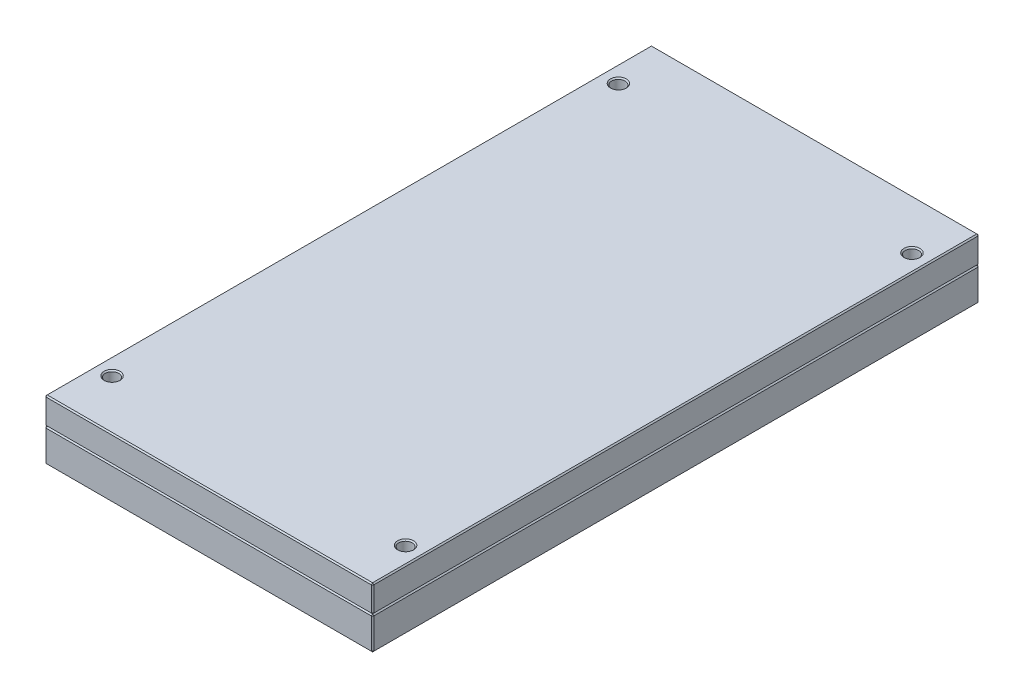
ISO-10303-21;
HEADER;
FILE_DESCRIPTION(('STEP AP214'),'2;1');
FILE_NAME('part.step','',(''),(''),'','','');
FILE_SCHEMA(('AUTOMOTIVE_DESIGN { 1 0 10303 214 1 1 1 1 }'));
ENDSEC;
DATA;
#1=APPLICATION_CONTEXT('core data for automotive mechanical design processes');
#2=APPLICATION_PROTOCOL_DEFINITION('international standard','automotive_design',2000,#1);
#3=PRODUCT_CONTEXT('',#1,'mechanical');
#4=PRODUCT('Part','Part','',(#3));
#5=PRODUCT_RELATED_PRODUCT_CATEGORY('part','',(#4));
#6=PRODUCT_DEFINITION_FORMATION('','',#4);
#7=PRODUCT_DEFINITION_CONTEXT('part definition',#1,'design');
#8=PRODUCT_DEFINITION('design','',#6,#7);
#9=PRODUCT_DEFINITION_SHAPE('','',#8);
#10=(LENGTH_UNIT() NAMED_UNIT(*) SI_UNIT(.MILLI.,.METRE.));
#11=(NAMED_UNIT(*) PLANE_ANGLE_UNIT() SI_UNIT($,.RADIAN.));
#12=(NAMED_UNIT(*) SI_UNIT($,.STERADIAN.) SOLID_ANGLE_UNIT());
#13=UNCERTAINTY_MEASURE_WITH_UNIT(LENGTH_MEASURE(1.E-05),#10,'distance_accuracy_value','');
#14=(GEOMETRIC_REPRESENTATION_CONTEXT(3) GLOBAL_UNCERTAINTY_ASSIGNED_CONTEXT((#13)) GLOBAL_UNIT_ASSIGNED_CONTEXT((#10,
#11,#12)) REPRESENTATION_CONTEXT('',''));
#15=CARTESIAN_POINT('',(0.,0.,0.));
#16=DIRECTION('',(0.,0.,1.));
#17=DIRECTION('',(1.,0.,0.));
#18=AXIS2_PLACEMENT_3D('',#15,#16,#17);
#19=CARTESIAN_POINT('',(-134.,49.,248.));
#20=DIRECTION('',(1.,0.,0.));
#21=DIRECTION('',(0.,0.,-1.));
#22=AXIS2_PLACEMENT_3D('',#19,#20,#21);
#23=PLANE('',#22);
#24=DIRECTION('',(0.,0.,1.));
#25=VECTOR('',#24,1.);
#26=CARTESIAN_POINT('',(-134.,28.,248.));
#27=LINE('',#26,#25);
#28=CARTESIAN_POINT('',(-134.,28.,-247.));
#29=VERTEX_POINT('',#28);
#30=CARTESIAN_POINT('',(-134.,28.,247.));
#31=VERTEX_POINT('',#30);
#32=EDGE_CURVE('P0_E220',#29,#31,#27,.T.);
#33=ORIENTED_EDGE('',*,*,#32,.T.);
#34=DIRECTION('',(0.,1.,0.));
#35=VECTOR('',#34,1.);
#36=CARTESIAN_POINT('',(-134.,49.,247.));
#37=LINE('',#36,#35);
#38=CARTESIAN_POINT('',(-134.,48.,247.));
#39=VERTEX_POINT('',#38);
#40=EDGE_CURVE('P0_E222',#31,#39,#37,.T.);
#41=ORIENTED_EDGE('',*,*,#40,.T.);
#42=DIRECTION('',(0.,0.,-1.));
#43=VECTOR('',#42,1.);
#44=CARTESIAN_POINT('',(-134.,48.,-248.));
#45=LINE('',#44,#43);
#46=CARTESIAN_POINT('',(-134.,48.,-247.));
#47=VERTEX_POINT('',#46);
#48=EDGE_CURVE('P0_E216',#39,#47,#45,.T.);
#49=ORIENTED_EDGE('',*,*,#48,.T.);
#50=DIRECTION('',(0.,-1.,0.));
#51=VECTOR('',#50,1.);
#52=CARTESIAN_POINT('',(-134.,49.,-247.));
#53=LINE('',#52,#51);
#54=EDGE_CURVE('P0_E218',#47,#29,#53,.T.);
#55=ORIENTED_EDGE('',*,*,#54,.T.);
#56=EDGE_LOOP('',(#33,#41,#49,#55));
#57=FACE_BOUND('',#56,.T.);
#58=ADVANCED_FACE('P0_F16',(#57),#23,.F.);
#59=CARTESIAN_POINT('',(134.,49.,248.));
#60=DIRECTION('',(0.,0.,-1.));
#61=DIRECTION('',(-1.,0.,0.));
#62=AXIS2_PLACEMENT_3D('',#59,#60,#61);
#63=PLANE('',#62);
#64=DIRECTION('',(0.,-1.,0.));
#65=VECTOR('',#64,1.);
#66=CARTESIAN_POINT('',(-133.,49.,248.));
#67=LINE('',#66,#65);
#68=CARTESIAN_POINT('',(-133.,48.,248.));
#69=VERTEX_POINT('',#68);
#70=CARTESIAN_POINT('',(-133.,28.,248.));
#71=VERTEX_POINT('',#70);
#72=EDGE_CURVE('P0_E116',#69,#71,#67,.T.);
#73=ORIENTED_EDGE('',*,*,#72,.T.);
#74=DIRECTION('',(1.,0.,0.));
#75=VECTOR('',#74,1.);
#76=CARTESIAN_POINT('',(134.,28.,248.));
#77=LINE('',#76,#75);
#78=CARTESIAN_POINT('',(133.,28.,248.));
#79=VERTEX_POINT('',#78);
#80=EDGE_CURVE('P0_E112',#71,#79,#77,.T.);
#81=ORIENTED_EDGE('',*,*,#80,.T.);
#82=DIRECTION('',(0.,1.,0.));
#83=VECTOR('',#82,1.);
#84=CARTESIAN_POINT('',(133.,49.,248.));
#85=LINE('',#84,#83);
#86=CARTESIAN_POINT('',(133.,48.,248.));
#87=VERTEX_POINT('',#86);
#88=EDGE_CURVE('P0_E106',#79,#87,#85,.T.);
#89=ORIENTED_EDGE('',*,*,#88,.T.);
#90=DIRECTION('',(-1.,0.,0.));
#91=VECTOR('',#90,1.);
#92=CARTESIAN_POINT('',(-134.,48.,248.));
#93=LINE('',#92,#91);
#94=EDGE_CURVE('P0_E109',#87,#69,#93,.T.);
#95=ORIENTED_EDGE('',*,*,#94,.T.);
#96=EDGE_LOOP('',(#73,#81,#89,#95));
#97=FACE_BOUND('',#96,.T.);
#98=ADVANCED_FACE('P0_F108',(#97),#63,.F.);
#99=CARTESIAN_POINT('',(134.,49.,248.));
#100=DIRECTION('',(-1.,0.,0.));
#101=DIRECTION('',(0.,0.,1.));
#102=AXIS2_PLACEMENT_3D('',#99,#100,#101);
#103=PLANE('',#102);
#104=DIRECTION('',(0.,0.,1.));
#105=VECTOR('',#104,1.);
#106=CARTESIAN_POINT('',(134.,48.,248.));
#107=LINE('',#106,#105);
#108=CARTESIAN_POINT('',(134.,48.,-247.));
#109=VERTEX_POINT('',#108);
#110=CARTESIAN_POINT('',(134.,48.,247.));
#111=VERTEX_POINT('',#110);
#112=EDGE_CURVE('P0_E234',#109,#111,#107,.T.);
#113=ORIENTED_EDGE('',*,*,#112,.T.);
#114=DIRECTION('',(0.,-1.,0.));
#115=VECTOR('',#114,1.);
#116=CARTESIAN_POINT('',(134.,49.,247.));
#117=LINE('',#116,#115);
#118=CARTESIAN_POINT('',(134.,28.,247.));
#119=VERTEX_POINT('',#118);
#120=EDGE_CURVE('P0_E139',#111,#119,#117,.T.);
#121=ORIENTED_EDGE('',*,*,#120,.T.);
#122=DIRECTION('',(0.,0.,-1.));
#123=VECTOR('',#122,1.);
#124=CARTESIAN_POINT('',(134.,28.,248.));
#125=LINE('',#124,#123);
#126=CARTESIAN_POINT('',(134.,28.,-247.));
#127=VERTEX_POINT('',#126);
#128=EDGE_CURVE('P0_E238',#119,#127,#125,.T.);
#129=ORIENTED_EDGE('',*,*,#128,.T.);
#130=DIRECTION('',(0.,1.,0.));
#131=VECTOR('',#130,1.);
#132=CARTESIAN_POINT('',(134.,49.,-247.));
#133=LINE('',#132,#131);
#134=EDGE_CURVE('P0_E236',#127,#109,#133,.T.);
#135=ORIENTED_EDGE('',*,*,#134,.T.);
#136=EDGE_LOOP('',(#113,#121,#129,#135));
#137=FACE_BOUND('',#136,.T.);
#138=ADVANCED_FACE('P0_F307',(#137),#103,.F.);
#139=CARTESIAN_POINT('',(134.,49.,-248.));
#140=DIRECTION('',(0.,0.,1.));
#141=DIRECTION('',(1.,0.,0.));
#142=AXIS2_PLACEMENT_3D('',#139,#140,#141);
#143=PLANE('',#142);
#144=DIRECTION('',(-1.,0.,0.));
#145=VECTOR('',#144,1.);
#146=CARTESIAN_POINT('',(134.,28.,-248.));
#147=LINE('',#146,#145);
#148=CARTESIAN_POINT('',(133.,28.,-248.));
#149=VERTEX_POINT('',#148);
#150=CARTESIAN_POINT('',(-133.,28.,-248.));
#151=VERTEX_POINT('',#150);
#152=EDGE_CURVE('P0_E229',#149,#151,#147,.T.);
#153=ORIENTED_EDGE('',*,*,#152,.T.);
#154=DIRECTION('',(0.,1.,0.));
#155=VECTOR('',#154,1.);
#156=CARTESIAN_POINT('',(-133.,49.,-248.));
#157=LINE('',#156,#155);
#158=CARTESIAN_POINT('',(-133.,48.,-248.));
#159=VERTEX_POINT('',#158);
#160=EDGE_CURVE('P0_E231',#151,#159,#157,.T.);
#161=ORIENTED_EDGE('',*,*,#160,.T.);
#162=DIRECTION('',(1.,0.,0.));
#163=VECTOR('',#162,1.);
#164=CARTESIAN_POINT('',(134.,48.,-248.));
#165=LINE('',#164,#163);
#166=CARTESIAN_POINT('',(133.,48.,-248.));
#167=VERTEX_POINT('',#166);
#168=EDGE_CURVE('P0_E225',#159,#167,#165,.T.);
#169=ORIENTED_EDGE('',*,*,#168,.T.);
#170=DIRECTION('',(0.,-1.,0.));
#171=VECTOR('',#170,1.);
#172=CARTESIAN_POINT('',(133.,49.,-248.));
#173=LINE('',#172,#171);
#174=EDGE_CURVE('P0_E227',#167,#149,#173,.T.);
#175=ORIENTED_EDGE('',*,*,#174,.T.);
#176=EDGE_LOOP('',(#153,#161,#169,#175));
#177=FACE_BOUND('',#176,.T.);
#178=ADVANCED_FACE('P0_F318',(#177),#143,.F.);
#179=CARTESIAN_POINT('',(0.,49.,0.));
#180=DIRECTION('',(0.,1.,0.));
#181=DIRECTION('',(0.,0.,1.));
#182=AXIS2_PLACEMENT_3D('',#179,#180,#181);
#183=PLANE('',#182);
#184=DIRECTION('',(0.,0.,-1.));
#185=VECTOR('',#184,1.);
#186=CARTESIAN_POINT('',(133.,49.,-248.));
#187=LINE('',#186,#185);
#188=CARTESIAN_POINT('',(133.,49.,247.));
#189=VERTEX_POINT('',#188);
#190=CARTESIAN_POINT('',(133.,49.,-247.));
#191=VERTEX_POINT('',#190);
#192=EDGE_CURVE('P0_E33',#189,#191,#187,.T.);
#193=ORIENTED_EDGE('',*,*,#192,.T.);
#194=DIRECTION('',(-1.,0.,0.));
#195=VECTOR('',#194,1.);
#196=CARTESIAN_POINT('',(-134.,49.,-247.));
#197=LINE('',#196,#195);
#198=CARTESIAN_POINT('',(-133.,49.,-247.));
#199=VERTEX_POINT('',#198);
#200=EDGE_CURVE('P0_E257',#191,#199,#197,.T.);
#201=ORIENTED_EDGE('',*,*,#200,.T.);
#202=DIRECTION('',(0.,0.,1.));
#203=VECTOR('',#202,1.);
#204=CARTESIAN_POINT('',(-133.,49.,248.));
#205=LINE('',#204,#203);
#206=CARTESIAN_POINT('',(-133.,49.,247.));
#207=VERTEX_POINT('',#206);
#208=EDGE_CURVE('P0_E253',#199,#207,#205,.T.);
#209=ORIENTED_EDGE('',*,*,#208,.T.);
#210=DIRECTION('',(1.,0.,0.));
#211=VECTOR('',#210,1.);
#212=CARTESIAN_POINT('',(134.,49.,247.));
#213=LINE('',#212,#211);
#214=EDGE_CURVE('P0_E38',#207,#189,#213,.T.);
#215=ORIENTED_EDGE('',*,*,#214,.T.);
#216=EDGE_LOOP('',(#193,#201,#209,#215));
#217=FACE_BOUND('',#216,.T.);
#218=CARTESIAN_POINT('',(120.,49.,207.));
#219=DIRECTION('',(0.,1.,0.));
#220=DIRECTION('',(0.,0.,1.));
#221=AXIS2_PLACEMENT_3D('',#218,#219,#220);
#222=CIRCLE('',#221,6.50000000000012);
#223=CARTESIAN_POINT('',(120.,49.,213.5));
#224=VERTEX_POINT('',#223);
#225=EDGE_CURVE('P0_E250',#224,#224,#222,.F.);
#226=ORIENTED_EDGE('',*,*,#225,.T.);
#227=EDGE_LOOP('',(#226));
#228=FACE_BOUND('',#227,.T.);
#229=CARTESIAN_POINT('',(-120.,49.,207.));
#230=DIRECTION('',(0.,1.,0.));
#231=DIRECTION('',(0.,0.,1.));
#232=AXIS2_PLACEMENT_3D('',#229,#230,#231);
#233=CIRCLE('',#232,6.50000000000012);
#234=CARTESIAN_POINT('',(-120.,49.,213.5));
#235=VERTEX_POINT('',#234);
#236=EDGE_CURVE('P0_E247',#235,#235,#233,.F.);
#237=ORIENTED_EDGE('',*,*,#236,.T.);
#238=EDGE_LOOP('',(#237));
#239=FACE_BOUND('',#238,.T.);
#240=CARTESIAN_POINT('',(120.,49.,-207.));
#241=DIRECTION('',(0.,1.,0.));
#242=DIRECTION('',(0.,0.,1.));
#243=AXIS2_PLACEMENT_3D('',#240,#241,#242);
#244=CIRCLE('',#243,6.50000000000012);
#245=CARTESIAN_POINT('',(120.,49.,-200.5));
#246=VERTEX_POINT('',#245);
#247=EDGE_CURVE('P0_E244',#246,#246,#244,.F.);
#248=ORIENTED_EDGE('',*,*,#247,.T.);
#249=EDGE_LOOP('',(#248));
#250=FACE_BOUND('',#249,.T.);
#251=CARTESIAN_POINT('',(-120.,49.,-207.));
#252=DIRECTION('',(0.,1.,0.));
#253=DIRECTION('',(0.,0.,1.));
#254=AXIS2_PLACEMENT_3D('',#251,#252,#253);
#255=CIRCLE('',#254,6.5);
#256=CARTESIAN_POINT('',(-120.,49.,-200.5));
#257=VERTEX_POINT('',#256);
#258=EDGE_CURVE('P0_E241',#257,#257,#255,.F.);
#259=ORIENTED_EDGE('',*,*,#258,.T.);
#260=EDGE_LOOP('',(#259));
#261=FACE_BOUND('',#260,.T.);
#262=ADVANCED_FACE('P0_F335',(#217,#228,#239,#250,#261),#183,.T.);
#263=CARTESIAN_POINT('',(0.,27.,0.));
#264=DIRECTION('',(0.,1.,0.));
#265=DIRECTION('',(0.,0.,1.));
#266=AXIS2_PLACEMENT_3D('',#263,#264,#265);
#267=PLANE('',#266);
#268=DIRECTION('',(0.,0.,1.));
#269=VECTOR('',#268,1.);
#270=CARTESIAN_POINT('',(133.,27.,0.));
#271=LINE('',#270,#269);
#272=CARTESIAN_POINT('',(133.,27.,-247.));
#273=VERTEX_POINT('',#272);
#274=CARTESIAN_POINT('',(133.,27.,247.));
#275=VERTEX_POINT('',#274);
#276=EDGE_CURVE('P0_E207',#273,#275,#271,.T.);
#277=ORIENTED_EDGE('',*,*,#276,.T.);
#278=DIRECTION('',(-1.,0.,0.));
#279=VECTOR('',#278,1.);
#280=CARTESIAN_POINT('',(0.,27.,247.));
#281=LINE('',#280,#279);
#282=CARTESIAN_POINT('',(-133.,27.,247.));
#283=VERTEX_POINT('',#282);
#284=EDGE_CURVE('P0_E213',#275,#283,#281,.T.);
#285=ORIENTED_EDGE('',*,*,#284,.T.);
#286=DIRECTION('',(0.,0.,-1.));
#287=VECTOR('',#286,1.);
#288=CARTESIAN_POINT('',(-133.,27.,0.));
#289=LINE('',#288,#287);
#290=CARTESIAN_POINT('',(-133.,27.,-247.));
#291=VERTEX_POINT('',#290);
#292=EDGE_CURVE('P0_E211',#283,#291,#289,.T.);
#293=ORIENTED_EDGE('',*,*,#292,.T.);
#294=DIRECTION('',(1.,0.,0.));
#295=VECTOR('',#294,1.);
#296=CARTESIAN_POINT('',(0.,27.,-247.));
#297=LINE('',#296,#295);
#298=EDGE_CURVE('P0_E209',#291,#273,#297,.T.);
#299=ORIENTED_EDGE('',*,*,#298,.T.);
#300=EDGE_LOOP('',(#277,#285,#293,#299));
#301=FACE_BOUND('',#300,.T.);
#302=CARTESIAN_POINT('',(-120.,27.,-207.));
#303=DIRECTION('',(0.,1.,0.));
#304=DIRECTION('',(0.,0.,1.));
#305=AXIS2_PLACEMENT_3D('',#302,#303,#304);
#306=CIRCLE('',#305,5.5);
#307=CARTESIAN_POINT('',(-120.,27.,-201.5));
#308=VERTEX_POINT('',#307);
#309=EDGE_CURVE('P0_E127',#308,#308,#306,.T.);
#310=ORIENTED_EDGE('',*,*,#309,.T.);
#311=EDGE_LOOP('',(#310));
#312=FACE_BOUND('',#311,.T.);
#313=CARTESIAN_POINT('',(120.,27.,-207.));
#314=DIRECTION('',(0.,1.,0.));
#315=DIRECTION('',(0.,0.,1.));
#316=AXIS2_PLACEMENT_3D('',#313,#314,#315);
#317=CIRCLE('',#316,5.5);
#318=CARTESIAN_POINT('',(120.,27.,-201.5));
#319=VERTEX_POINT('',#318);
#320=EDGE_CURVE('P0_E198',#319,#319,#317,.T.);
#321=ORIENTED_EDGE('',*,*,#320,.T.);
#322=EDGE_LOOP('',(#321));
#323=FACE_BOUND('',#322,.T.);
#324=CARTESIAN_POINT('',(-120.,27.,207.));
#325=DIRECTION('',(0.,1.,0.));
#326=DIRECTION('',(0.,0.,1.));
#327=AXIS2_PLACEMENT_3D('',#324,#325,#326);
#328=CIRCLE('',#327,5.5);
#329=CARTESIAN_POINT('',(-120.,27.,212.5));
#330=VERTEX_POINT('',#329);
#331=EDGE_CURVE('P0_E193',#330,#330,#328,.T.);
#332=ORIENTED_EDGE('',*,*,#331,.T.);
#333=EDGE_LOOP('',(#332));
#334=FACE_BOUND('',#333,.T.);
#335=CARTESIAN_POINT('',(120.,27.,207.));
#336=DIRECTION('',(0.,1.,0.));
#337=DIRECTION('',(0.,0.,1.));
#338=AXIS2_PLACEMENT_3D('',#335,#336,#337);
#339=CIRCLE('',#338,5.5);
#340=CARTESIAN_POINT('',(120.,27.,212.5));
#341=VERTEX_POINT('',#340);
#342=EDGE_CURVE('P0_E186',#341,#341,#339,.T.);
#343=ORIENTED_EDGE('',*,*,#342,.T.);
#344=EDGE_LOOP('',(#343));
#345=FACE_BOUND('',#344,.T.);
#346=ADVANCED_FACE('P0_F292',(#301,#312,#323,#334,#345),#267,.F.);
#347=CARTESIAN_POINT('',(120.,0.,207.));
#348=DIRECTION('',(0.,1.,0.));
#349=DIRECTION('',(0.,0.,1.));
#350=AXIS2_PLACEMENT_3D('',#347,#348,#349);
#351=CYLINDRICAL_SURFACE('',#350,5.5);
#352=CARTESIAN_POINT('',(120.,48.,207.));
#353=DIRECTION('',(0.,1.,0.));
#354=DIRECTION('',(0.,0.,1.));
#355=AXIS2_PLACEMENT_3D('',#352,#353,#354);
#356=CIRCLE('',#355,5.5);
#357=CARTESIAN_POINT('',(120.,48.,212.5));
#358=VERTEX_POINT('',#357);
#359=EDGE_CURVE('P0_E259',#358,#358,#356,.T.);
#360=ORIENTED_EDGE('',*,*,#359,.T.);
#361=EDGE_LOOP('',(#360));
#362=FACE_BOUND('',#361,.T.);
#363=ORIENTED_EDGE('',*,*,#342,.F.);
#364=EDGE_LOOP('',(#363));
#365=FACE_BOUND('',#364,.T.);
#366=ADVANCED_FACE('P0_F427',(#362,#365),#351,.F.);
#367=CARTESIAN_POINT('',(-120.,0.,207.));
#368=DIRECTION('',(0.,1.,0.));
#369=DIRECTION('',(0.,0.,1.));
#370=AXIS2_PLACEMENT_3D('',#367,#368,#369);
#371=CYLINDRICAL_SURFACE('',#370,5.5);
#372=CARTESIAN_POINT('',(-120.,48.,207.));
#373=DIRECTION('',(0.,1.,0.));
#374=DIRECTION('',(0.,0.,1.));
#375=AXIS2_PLACEMENT_3D('',#372,#373,#374);
#376=CIRCLE('',#375,5.5);
#377=CARTESIAN_POINT('',(-120.,48.,212.5));
#378=VERTEX_POINT('',#377);
#379=EDGE_CURVE('P0_E262',#378,#378,#376,.T.);
#380=ORIENTED_EDGE('',*,*,#379,.T.);
#381=EDGE_LOOP('',(#380));
#382=FACE_BOUND('',#381,.T.);
#383=ORIENTED_EDGE('',*,*,#331,.F.);
#384=EDGE_LOOP('',(#383));
#385=FACE_BOUND('',#384,.T.);
#386=ADVANCED_FACE('P0_F421',(#382,#385),#371,.F.);
#387=CARTESIAN_POINT('',(120.,0.,-207.));
#388=DIRECTION('',(0.,1.,0.));
#389=DIRECTION('',(0.,0.,1.));
#390=AXIS2_PLACEMENT_3D('',#387,#388,#389);
#391=CYLINDRICAL_SURFACE('',#390,5.5);
#392=CARTESIAN_POINT('',(120.,48.,-207.));
#393=DIRECTION('',(0.,1.,0.));
#394=DIRECTION('',(0.,0.,1.));
#395=AXIS2_PLACEMENT_3D('',#392,#393,#394);
#396=CIRCLE('',#395,5.5);
#397=CARTESIAN_POINT('',(120.,48.,-201.5));
#398=VERTEX_POINT('',#397);
#399=EDGE_CURVE('P0_E25',#398,#398,#396,.T.);
#400=ORIENTED_EDGE('',*,*,#399,.T.);
#401=EDGE_LOOP('',(#400));
#402=FACE_BOUND('',#401,.T.);
#403=ORIENTED_EDGE('',*,*,#320,.F.);
#404=EDGE_LOOP('',(#403));
#405=FACE_BOUND('',#404,.T.);
#406=ADVANCED_FACE('P0_F418',(#402,#405),#391,.F.);
#407=CARTESIAN_POINT('',(-120.,0.,-207.));
#408=DIRECTION('',(0.,1.,0.));
#409=DIRECTION('',(0.,0.,1.));
#410=AXIS2_PLACEMENT_3D('',#407,#408,#409);
#411=CYLINDRICAL_SURFACE('',#410,5.5);
#412=CARTESIAN_POINT('',(-120.,48.,-207.));
#413=DIRECTION('',(0.,1.,0.));
#414=DIRECTION('',(0.,0.,1.));
#415=AXIS2_PLACEMENT_3D('',#412,#413,#414);
#416=CIRCLE('',#415,5.5);
#417=CARTESIAN_POINT('',(-120.,48.,-201.5));
#418=VERTEX_POINT('',#417);
#419=EDGE_CURVE('P0_E10',#418,#418,#416,.T.);
#420=ORIENTED_EDGE('',*,*,#419,.T.);
#421=EDGE_LOOP('',(#420));
#422=FACE_BOUND('',#421,.T.);
#423=ORIENTED_EDGE('',*,*,#309,.F.);
#424=EDGE_LOOP('',(#423));
#425=FACE_BOUND('',#424,.T.);
#426=ADVANCED_FACE('P0_F399',(#422,#425),#411,.F.);
#427=CARTESIAN_POINT('',(0.,49.,-247.));
#428=DIRECTION('',(0.,0.707106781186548,-0.707106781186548));
#429=DIRECTION('',(1.,0.,0.));
#430=AXIS2_PLACEMENT_3D('',#427,#428,#429);
#431=PLANE('',#430);
#432=DIRECTION('',(0.,-0.707106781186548,-0.707106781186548));
#433=VECTOR('',#432,1.);
#434=CARTESIAN_POINT('',(-133.,48.,-248.));
#435=LINE('',#434,#433);
#436=EDGE_CURVE('P0_E20',#199,#159,#435,.T.);
#437=ORIENTED_EDGE('',*,*,#436,.F.);
#438=ORIENTED_EDGE('',*,*,#200,.F.);
#439=DIRECTION('',(0.,0.707106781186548,0.707106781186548));
#440=VECTOR('',#439,1.);
#441=CARTESIAN_POINT('',(133.,48.5,-247.5));
#442=LINE('',#441,#440);
#443=EDGE_CURVE('P0_E179',#167,#191,#442,.T.);
#444=ORIENTED_EDGE('',*,*,#443,.F.);
#445=ORIENTED_EDGE('',*,*,#168,.F.);
#446=EDGE_LOOP('',(#437,#438,#444,#445));
#447=FACE_BOUND('',#446,.T.);
#448=ADVANCED_FACE('P0_F334',(#447),#431,.T.);
#449=CARTESIAN_POINT('',(-133.,48.,-248.));
#450=DIRECTION('',(-0.577350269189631,0.577350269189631,-0.577350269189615));
#451=DIRECTION('',(-0.707106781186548,-0.707106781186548,0.));
#452=AXIS2_PLACEMENT_3D('',#449,#450,#451);
#453=PLANE('',#452);
#454=DIRECTION('',(0.707106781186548,0.707106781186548,0.));
#455=VECTOR('',#454,1.);
#456=CARTESIAN_POINT('',(-133.5,48.5,-247.));
#457=LINE('',#456,#455);
#458=EDGE_CURVE('P0_E175',#199,#47,#457,.F.);
#459=ORIENTED_EDGE('',*,*,#458,.F.);
#460=ORIENTED_EDGE('',*,*,#436,.T.);
#461=DIRECTION('',(0.707106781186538,0.,-0.707106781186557));
#462=VECTOR('',#461,1.);
#463=CARTESIAN_POINT('',(-133.,48.,-248.));
#464=LINE('',#463,#462);
#465=EDGE_CURVE('P0_E178',#47,#159,#464,.T.);
#466=ORIENTED_EDGE('',*,*,#465,.F.);
#467=EDGE_LOOP('',(#459,#460,#466));
#468=FACE_BOUND('',#467,.T.);
#469=ADVANCED_FACE('P0_F330',(#468),#453,.T.);
#470=CARTESIAN_POINT('',(134.,48.,-247.));
#471=DIRECTION('',(0.577350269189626,0.577350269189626,-0.577350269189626));
#472=DIRECTION('',(-0.707106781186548,0.,-0.707106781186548));
#473=AXIS2_PLACEMENT_3D('',#470,#471,#472);
#474=PLANE('',#473);
#475=DIRECTION('',(0.707106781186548,0.,0.707106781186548));
#476=VECTOR('',#475,1.);
#477=CARTESIAN_POINT('',(134.,48.,-247.));
#478=LINE('',#477,#476);
#479=EDGE_CURVE('P0_E169',#167,#109,#478,.T.);
#480=ORIENTED_EDGE('',*,*,#479,.F.);
#481=ORIENTED_EDGE('',*,*,#443,.T.);
#482=DIRECTION('',(0.707106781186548,-0.707106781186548,0.));
#483=VECTOR('',#482,1.);
#484=CARTESIAN_POINT('',(134.,48.,-247.));
#485=LINE('',#484,#483);
#486=EDGE_CURVE('P0_E172',#109,#191,#485,.F.);
#487=ORIENTED_EDGE('',*,*,#486,.F.);
#488=EDGE_LOOP('',(#480,#481,#487));
#489=FACE_BOUND('',#488,.T.);
#490=ADVANCED_FACE('P0_F311',(#489),#474,.T.);
#491=CARTESIAN_POINT('',(-134.,49.,-247.));
#492=DIRECTION('',(0.707106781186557,0.,0.707106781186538));
#493=DIRECTION('',(0.,-1.,0.));
#494=AXIS2_PLACEMENT_3D('',#491,#492,#493);
#495=PLANE('',#494);
#496=ORIENTED_EDGE('',*,*,#465,.T.);
#497=ORIENTED_EDGE('',*,*,#160,.F.);
#498=DIRECTION('',(-0.707106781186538,0.,0.707106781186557));
#499=VECTOR('',#498,1.);
#500=CARTESIAN_POINT('',(-133.5,28.,-247.5));
#501=LINE('',#500,#499);
#502=EDGE_CURVE('P0_E163',#29,#151,#501,.F.);
#503=ORIENTED_EDGE('',*,*,#502,.F.);
#504=ORIENTED_EDGE('',*,*,#54,.F.);
#505=EDGE_LOOP('',(#496,#497,#503,#504));
#506=FACE_BOUND('',#505,.T.);
#507=ADVANCED_FACE('P0_F329',(#506),#495,.F.);
#508=CARTESIAN_POINT('',(-133.,49.,0.));
#509=DIRECTION('',(-0.707106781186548,0.707106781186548,0.));
#510=DIRECTION('',(0.,0.,-1.));
#511=AXIS2_PLACEMENT_3D('',#508,#509,#510);
#512=PLANE('',#511);
#513=ORIENTED_EDGE('',*,*,#458,.T.);
#514=ORIENTED_EDGE('',*,*,#48,.F.);
#515=DIRECTION('',(-0.707106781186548,-0.707106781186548,0.));
#516=VECTOR('',#515,1.);
#517=CARTESIAN_POINT('',(-134.,48.,247.));
#518=LINE('',#517,#516);
#519=EDGE_CURVE('P0_E160',#207,#39,#518,.T.);
#520=ORIENTED_EDGE('',*,*,#519,.F.);
#521=ORIENTED_EDGE('',*,*,#208,.F.);
#522=EDGE_LOOP('',(#513,#514,#520,#521));
#523=FACE_BOUND('',#522,.T.);
#524=ADVANCED_FACE('P0_F338',(#523),#512,.T.);
#525=CARTESIAN_POINT('',(0.,49.,247.));
#526=DIRECTION('',(0.,0.707106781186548,0.707106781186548));
#527=DIRECTION('',(-1.,0.,0.));
#528=AXIS2_PLACEMENT_3D('',#525,#526,#527);
#529=PLANE('',#528);
#530=DIRECTION('',(0.,-0.707106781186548,0.707106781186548));
#531=VECTOR('',#530,1.);
#532=CARTESIAN_POINT('',(133.,48.,248.));
#533=LINE('',#532,#531);
#534=EDGE_CURVE('P0_E122',#189,#87,#533,.T.);
#535=ORIENTED_EDGE('',*,*,#534,.F.);
#536=ORIENTED_EDGE('',*,*,#214,.F.);
#537=DIRECTION('',(0.,0.707106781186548,-0.707106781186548));
#538=VECTOR('',#537,1.);
#539=CARTESIAN_POINT('',(-133.,48.5,247.5));
#540=LINE('',#539,#538);
#541=EDGE_CURVE('P0_E125',#69,#207,#540,.T.);
#542=ORIENTED_EDGE('',*,*,#541,.F.);
#543=ORIENTED_EDGE('',*,*,#94,.F.);
#544=EDGE_LOOP('',(#535,#536,#542,#543));
#545=FACE_BOUND('',#544,.T.);
#546=ADVANCED_FACE('P0_F121',(#545),#529,.T.);
#547=CARTESIAN_POINT('',(133.,49.,0.));
#548=DIRECTION('',(0.707106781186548,0.707106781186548,0.));
#549=DIRECTION('',(0.,0.,1.));
#550=AXIS2_PLACEMENT_3D('',#547,#548,#549);
#551=PLANE('',#550);
#552=ORIENTED_EDGE('',*,*,#486,.T.);
#553=ORIENTED_EDGE('',*,*,#192,.F.);
#554=DIRECTION('',(-0.707106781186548,0.707106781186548,0.));
#555=VECTOR('',#554,1.);
#556=CARTESIAN_POINT('',(133.5,48.5,247.));
#557=LINE('',#556,#555);
#558=EDGE_CURVE('P0_E135',#111,#189,#557,.T.);
#559=ORIENTED_EDGE('',*,*,#558,.F.);
#560=ORIENTED_EDGE('',*,*,#112,.F.);
#561=EDGE_LOOP('',(#552,#553,#559,#560));
#562=FACE_BOUND('',#561,.T.);
#563=ADVANCED_FACE('P0_F310',(#562),#551,.T.);
#564=CARTESIAN_POINT('',(133.,49.,-248.));
#565=DIRECTION('',(-0.707106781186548,0.,0.707106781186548));
#566=DIRECTION('',(0.,-1.,0.));
#567=AXIS2_PLACEMENT_3D('',#564,#565,#566);
#568=PLANE('',#567);
#569=ORIENTED_EDGE('',*,*,#479,.T.);
#570=ORIENTED_EDGE('',*,*,#134,.F.);
#571=DIRECTION('',(-0.707106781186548,0.,-0.707106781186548));
#572=VECTOR('',#571,1.);
#573=CARTESIAN_POINT('',(133.5,28.,-247.5));
#574=LINE('',#573,#572);
#575=EDGE_CURVE('P0_E155',#149,#127,#574,.F.);
#576=ORIENTED_EDGE('',*,*,#575,.F.);
#577=ORIENTED_EDGE('',*,*,#174,.F.);
#578=EDGE_LOOP('',(#569,#570,#576,#577));
#579=FACE_BOUND('',#578,.T.);
#580=ADVANCED_FACE('P0_F315',(#579),#568,.F.);
#581=CARTESIAN_POINT('',(134.,28.,-248.));
#582=DIRECTION('',(0.,0.707106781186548,0.707106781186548));
#583=DIRECTION('',(-1.,0.,0.));
#584=AXIS2_PLACEMENT_3D('',#581,#582,#583);
#585=PLANE('',#584);
#586=DIRECTION('',(0.,0.707106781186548,-0.707106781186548));
#587=VECTOR('',#586,1.);
#588=CARTESIAN_POINT('',(-133.,27.,-247.));
#589=LINE('',#588,#587);
#590=EDGE_CURVE('P0_E166',#151,#291,#589,.F.);
#591=ORIENTED_EDGE('',*,*,#590,.F.);
#592=ORIENTED_EDGE('',*,*,#152,.F.);
#593=DIRECTION('',(0.,-0.707106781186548,0.707106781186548));
#594=VECTOR('',#593,1.);
#595=CARTESIAN_POINT('',(133.,27.,-247.));
#596=LINE('',#595,#594);
#597=EDGE_CURVE('P0_E152',#273,#149,#596,.F.);
#598=ORIENTED_EDGE('',*,*,#597,.F.);
#599=ORIENTED_EDGE('',*,*,#298,.F.);
#600=EDGE_LOOP('',(#591,#592,#598,#599));
#601=FACE_BOUND('',#600,.T.);
#602=ADVANCED_FACE('P0_F323',(#601),#585,.F.);
#603=CARTESIAN_POINT('',(-133.,27.,-247.));
#604=DIRECTION('',(-0.577350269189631,-0.577350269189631,-0.577350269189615));
#605=DIRECTION('',(0.707106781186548,-0.707106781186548,0.));
#606=AXIS2_PLACEMENT_3D('',#603,#604,#605);
#607=PLANE('',#606);
#608=ORIENTED_EDGE('',*,*,#502,.T.);
#609=ORIENTED_EDGE('',*,*,#590,.T.);
#610=DIRECTION('',(0.707106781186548,-0.707106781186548,0.));
#611=VECTOR('',#610,1.);
#612=CARTESIAN_POINT('',(-133.,27.,-247.));
#613=LINE('',#612,#611);
#614=EDGE_CURVE('P0_E143',#29,#291,#613,.T.);
#615=ORIENTED_EDGE('',*,*,#614,.F.);
#616=EDGE_LOOP('',(#608,#609,#615));
#617=FACE_BOUND('',#616,.T.);
#618=ADVANCED_FACE('P0_F326',(#617),#607,.T.);
#619=CARTESIAN_POINT('',(-134.,48.,247.));
#620=DIRECTION('',(-0.577350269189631,0.577350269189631,0.577350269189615));
#621=DIRECTION('',(-0.707106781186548,-0.707106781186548,0.));
#622=AXIS2_PLACEMENT_3D('',#619,#620,#621);
#623=PLANE('',#622);
#624=ORIENTED_EDGE('',*,*,#541,.T.);
#625=ORIENTED_EDGE('',*,*,#519,.T.);
#626=DIRECTION('',(-0.707106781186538,0.,-0.707106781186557));
#627=VECTOR('',#626,1.);
#628=CARTESIAN_POINT('',(-134.,48.,247.));
#629=LINE('',#628,#627);
#630=EDGE_CURVE('P0_E140',#69,#39,#629,.T.);
#631=ORIENTED_EDGE('',*,*,#630,.F.);
#632=EDGE_LOOP('',(#624,#625,#631));
#633=FACE_BOUND('',#632,.T.);
#634=ADVANCED_FACE('P0_F340',(#633),#623,.T.);
#635=CARTESIAN_POINT('',(133.,48.,248.));
#636=DIRECTION('',(0.577350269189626,0.577350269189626,0.577350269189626));
#637=DIRECTION('',(0.707106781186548,0.,-0.707106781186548));
#638=AXIS2_PLACEMENT_3D('',#635,#636,#637);
#639=PLANE('',#638);
#640=ORIENTED_EDGE('',*,*,#558,.T.);
#641=ORIENTED_EDGE('',*,*,#534,.T.);
#642=DIRECTION('',(-0.707106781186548,0.,0.707106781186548));
#643=VECTOR('',#642,1.);
#644=CARTESIAN_POINT('',(133.,48.,248.));
#645=LINE('',#644,#643);
#646=EDGE_CURVE('P0_E132',#111,#87,#645,.T.);
#647=ORIENTED_EDGE('',*,*,#646,.F.);
#648=EDGE_LOOP('',(#640,#641,#647));
#649=FACE_BOUND('',#648,.T.);
#650=ADVANCED_FACE('P0_F131',(#649),#639,.T.);
#651=CARTESIAN_POINT('',(133.,27.,-247.));
#652=DIRECTION('',(0.577350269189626,-0.577350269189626,-0.577350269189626));
#653=DIRECTION('',(-0.707106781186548,0.,-0.707106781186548));
#654=AXIS2_PLACEMENT_3D('',#651,#652,#653);
#655=PLANE('',#654);
#656=ORIENTED_EDGE('',*,*,#597,.T.);
#657=ORIENTED_EDGE('',*,*,#575,.T.);
#658=DIRECTION('',(0.707106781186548,0.707106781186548,0.));
#659=VECTOR('',#658,1.);
#660=CARTESIAN_POINT('',(133.,27.,-247.));
#661=LINE('',#660,#659);
#662=EDGE_CURVE('P0_E141',#273,#127,#661,.T.);
#663=ORIENTED_EDGE('',*,*,#662,.F.);
#664=EDGE_LOOP('',(#656,#657,#663));
#665=FACE_BOUND('',#664,.T.);
#666=ADVANCED_FACE('P0_F371',(#665),#655,.T.);
#667=CARTESIAN_POINT('',(-134.,28.,248.));
#668=DIRECTION('',(0.707106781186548,0.707106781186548,0.));
#669=DIRECTION('',(0.,0.,1.));
#670=AXIS2_PLACEMENT_3D('',#667,#668,#669);
#671=PLANE('',#670);
#672=ORIENTED_EDGE('',*,*,#614,.T.);
#673=ORIENTED_EDGE('',*,*,#292,.F.);
#674=DIRECTION('',(-0.707106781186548,0.707106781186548,0.));
#675=VECTOR('',#674,1.);
#676=CARTESIAN_POINT('',(-133.,27.,247.));
#677=LINE('',#676,#675);
#678=EDGE_CURVE('P0_E146',#31,#283,#677,.F.);
#679=ORIENTED_EDGE('',*,*,#678,.F.);
#680=ORIENTED_EDGE('',*,*,#32,.F.);
#681=EDGE_LOOP('',(#672,#673,#679,#680));
#682=FACE_BOUND('',#681,.T.);
#683=ADVANCED_FACE('P0_F287',(#682),#671,.F.);
#684=CARTESIAN_POINT('',(-133.,49.,248.));
#685=DIRECTION('',(0.707106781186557,0.,-0.707106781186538));
#686=DIRECTION('',(0.,-1.,0.));
#687=AXIS2_PLACEMENT_3D('',#684,#685,#686);
#688=PLANE('',#687);
#689=ORIENTED_EDGE('',*,*,#630,.T.);
#690=ORIENTED_EDGE('',*,*,#40,.F.);
#691=DIRECTION('',(0.707106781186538,0.,0.707106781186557));
#692=VECTOR('',#691,1.);
#693=CARTESIAN_POINT('',(-133.5,28.,247.5));
#694=LINE('',#693,#692);
#695=EDGE_CURVE('P0_E276',#71,#31,#694,.F.);
#696=ORIENTED_EDGE('',*,*,#695,.F.);
#697=ORIENTED_EDGE('',*,*,#72,.F.);
#698=EDGE_LOOP('',(#689,#690,#696,#697));
#699=FACE_BOUND('',#698,.T.);
#700=ADVANCED_FACE('P0_F344',(#699),#688,.F.);
#701=CARTESIAN_POINT('',(134.,49.,247.));
#702=DIRECTION('',(-0.707106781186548,0.,-0.707106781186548));
#703=DIRECTION('',(0.,-1.,0.));
#704=AXIS2_PLACEMENT_3D('',#701,#702,#703);
#705=PLANE('',#704);
#706=ORIENTED_EDGE('',*,*,#646,.T.);
#707=ORIENTED_EDGE('',*,*,#88,.F.);
#708=DIRECTION('',(0.707106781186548,0.,-0.707106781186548));
#709=VECTOR('',#708,1.);
#710=CARTESIAN_POINT('',(133.,28.,248.));
#711=LINE('',#710,#709);
#712=EDGE_CURVE('P0_E273',#119,#79,#711,.F.);
#713=ORIENTED_EDGE('',*,*,#712,.F.);
#714=ORIENTED_EDGE('',*,*,#120,.F.);
#715=EDGE_LOOP('',(#706,#707,#713,#714));
#716=FACE_BOUND('',#715,.T.);
#717=ADVANCED_FACE('P0_F137',(#716),#705,.F.);
#718=CARTESIAN_POINT('',(134.,28.,248.));
#719=DIRECTION('',(-0.707106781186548,0.707106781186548,0.));
#720=DIRECTION('',(0.,0.,-1.));
#721=AXIS2_PLACEMENT_3D('',#718,#719,#720);
#722=PLANE('',#721);
#723=ORIENTED_EDGE('',*,*,#662,.T.);
#724=ORIENTED_EDGE('',*,*,#128,.F.);
#725=DIRECTION('',(-0.707106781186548,-0.707106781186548,0.));
#726=VECTOR('',#725,1.);
#727=CARTESIAN_POINT('',(133.5,27.5,247.));
#728=LINE('',#727,#726);
#729=EDGE_CURVE('P0_E271',#275,#119,#728,.F.);
#730=ORIENTED_EDGE('',*,*,#729,.F.);
#731=ORIENTED_EDGE('',*,*,#276,.F.);
#732=EDGE_LOOP('',(#723,#724,#730,#731));
#733=FACE_BOUND('',#732,.T.);
#734=ADVANCED_FACE('P0_F303',(#733),#722,.F.);
#735=CARTESIAN_POINT('',(-133.,27.,247.));
#736=DIRECTION('',(-0.577350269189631,-0.577350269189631,0.577350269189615));
#737=DIRECTION('',(0.707106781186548,-0.707106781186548,0.));
#738=AXIS2_PLACEMENT_3D('',#735,#736,#737);
#739=PLANE('',#738);
#740=ORIENTED_EDGE('',*,*,#695,.T.);
#741=ORIENTED_EDGE('',*,*,#678,.T.);
#742=DIRECTION('',(0.,-0.707106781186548,-0.707106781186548));
#743=VECTOR('',#742,1.);
#744=CARTESIAN_POINT('',(-133.,27.,247.));
#745=LINE('',#744,#743);
#746=EDGE_CURVE('P0_E269',#71,#283,#745,.T.);
#747=ORIENTED_EDGE('',*,*,#746,.F.);
#748=EDGE_LOOP('',(#740,#741,#747));
#749=FACE_BOUND('',#748,.T.);
#750=ADVANCED_FACE('P0_F283',(#749),#739,.T.);
#751=CARTESIAN_POINT('',(133.,28.,248.));
#752=DIRECTION('',(0.577350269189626,-0.577350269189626,0.577350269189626));
#753=DIRECTION('',(0.707106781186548,0.,-0.707106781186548));
#754=AXIS2_PLACEMENT_3D('',#751,#752,#753);
#755=PLANE('',#754);
#756=ORIENTED_EDGE('',*,*,#729,.T.);
#757=ORIENTED_EDGE('',*,*,#712,.T.);
#758=DIRECTION('',(0.,0.707106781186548,0.707106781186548));
#759=VECTOR('',#758,1.);
#760=CARTESIAN_POINT('',(133.,28.,248.));
#761=LINE('',#760,#759);
#762=EDGE_CURVE('P0_E267',#275,#79,#761,.T.);
#763=ORIENTED_EDGE('',*,*,#762,.F.);
#764=EDGE_LOOP('',(#756,#757,#763));
#765=FACE_BOUND('',#764,.T.);
#766=ADVANCED_FACE('P0_F300',(#765),#755,.T.);
#767=CARTESIAN_POINT('',(134.,28.,248.));
#768=DIRECTION('',(0.,0.707106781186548,-0.707106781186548));
#769=DIRECTION('',(1.,0.,0.));
#770=AXIS2_PLACEMENT_3D('',#767,#768,#769);
#771=PLANE('',#770);
#772=ORIENTED_EDGE('',*,*,#746,.T.);
#773=ORIENTED_EDGE('',*,*,#284,.F.);
#774=ORIENTED_EDGE('',*,*,#762,.T.);
#775=ORIENTED_EDGE('',*,*,#80,.F.);
#776=EDGE_LOOP('',(#772,#773,#774,#775));
#777=FACE_BOUND('',#776,.T.);
#778=ADVANCED_FACE('P0_F298',(#777),#771,.F.);
#779=CARTESIAN_POINT('',(120.,48.,207.));
#780=DIRECTION('',(0.,1.,0.));
#781=DIRECTION('',(0.,0.,1.));
#782=AXIS2_PLACEMENT_3D('',#779,#780,#781);
#783=CONICAL_SURFACE('',#782,5.5,0.785398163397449);
#784=ORIENTED_EDGE('',*,*,#225,.F.);
#785=EDGE_LOOP('',(#784));
#786=FACE_BOUND('',#785,.T.);
#787=ORIENTED_EDGE('',*,*,#359,.F.);
#788=EDGE_LOOP('',(#787));
#789=FACE_BOUND('',#788,.T.);
#790=ADVANCED_FACE('P0_F358',(#786,#789),#783,.F.);
#791=CARTESIAN_POINT('',(-120.,48.,207.));
#792=DIRECTION('',(0.,1.,0.));
#793=DIRECTION('',(0.,0.,1.));
#794=AXIS2_PLACEMENT_3D('',#791,#792,#793);
#795=CONICAL_SURFACE('',#794,5.5,0.785398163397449);
#796=ORIENTED_EDGE('',*,*,#236,.F.);
#797=EDGE_LOOP('',(#796));
#798=FACE_BOUND('',#797,.T.);
#799=ORIENTED_EDGE('',*,*,#379,.F.);
#800=EDGE_LOOP('',(#799));
#801=FACE_BOUND('',#800,.T.);
#802=ADVANCED_FACE('P0_F402',(#798,#801),#795,.F.);
#803=CARTESIAN_POINT('',(120.,48.,-207.));
#804=DIRECTION('',(0.,1.,0.));
#805=DIRECTION('',(0.,0.,1.));
#806=AXIS2_PLACEMENT_3D('',#803,#804,#805);
#807=CONICAL_SURFACE('',#806,5.5,0.785398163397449);
#808=ORIENTED_EDGE('',*,*,#247,.F.);
#809=EDGE_LOOP('',(#808));
#810=FACE_BOUND('',#809,.T.);
#811=ORIENTED_EDGE('',*,*,#399,.F.);
#812=EDGE_LOOP('',(#811));
#813=FACE_BOUND('',#812,.T.);
#814=ADVANCED_FACE('P0_F405',(#810,#813),#807,.F.);
#815=CARTESIAN_POINT('',(-120.,48.,-207.));
#816=DIRECTION('',(0.,1.,0.));
#817=DIRECTION('',(0.,0.,1.));
#818=AXIS2_PLACEMENT_3D('',#815,#816,#817);
#819=CONICAL_SURFACE('',#818,5.5,0.785398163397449);
#820=ORIENTED_EDGE('',*,*,#258,.F.);
#821=EDGE_LOOP('',(#820));
#822=FACE_BOUND('',#821,.T.);
#823=ORIENTED_EDGE('',*,*,#419,.F.);
#824=EDGE_LOOP('',(#823));
#825=FACE_BOUND('',#824,.T.);
#826=ADVANCED_FACE('P0_F18',(#822,#825),#819,.F.);
#827=CLOSED_SHELL('',(#58,#98,#138,#178,#262,#346,#366,#386,#406,#426,#448,#469,#490,#507,#524,
#546,#563,#580,#602,#618,#634,#650,#666,#683,#700,#717,#734,#750,#766,#778,#790,#802,#814,#826));
#828=MANIFOLD_SOLID_BREP('P0_B1',#827);
#829=CARTESIAN_POINT('',(120.,0.,207.));
#830=DIRECTION('',(0.,1.,0.));
#831=DIRECTION('',(0.,0.,1.));
#832=AXIS2_PLACEMENT_3D('',#829,#830,#831);
#833=CYLINDRICAL_SURFACE('',#832,5.5);
#834=CARTESIAN_POINT('',(120.,27.,207.));
#835=DIRECTION('',(0.,1.,0.));
#836=DIRECTION('',(0.,0.,1.));
#837=AXIS2_PLACEMENT_3D('',#834,#835,#836);
#838=CIRCLE('',#837,5.5);
#839=CARTESIAN_POINT('',(120.,27.,212.5));
#840=VERTEX_POINT('',#839);
#841=EDGE_CURVE('P1_E290',#840,#840,#838,.T.);
#842=ORIENTED_EDGE('',*,*,#841,.T.);
#843=EDGE_LOOP('',(#842));
#844=FACE_BOUND('',#843,.T.);
#845=CARTESIAN_POINT('',(120.,13.,207.));
#846=DIRECTION('',(0.,-1.,0.));
#847=DIRECTION('',(0.,0.,-1.));
#848=AXIS2_PLACEMENT_3D('',#845,#846,#847);
#849=CIRCLE('',#848,5.5);
#850=CARTESIAN_POINT('',(120.,13.,201.5));
#851=VERTEX_POINT('',#850);
#852=EDGE_CURVE('P1_E151',#851,#851,#849,.F.);
#853=ORIENTED_EDGE('',*,*,#852,.F.);
#854=EDGE_LOOP('',(#853));
#855=FACE_BOUND('',#854,.T.);
#856=ADVANCED_FACE('P1_F16',(#844,#855),#833,.F.);
#857=CARTESIAN_POINT('',(-120.,0.,207.));
#858=DIRECTION('',(0.,1.,0.));
#859=DIRECTION('',(0.,0.,1.));
#860=AXIS2_PLACEMENT_3D('',#857,#858,#859);
#861=CYLINDRICAL_SURFACE('',#860,5.5);
#862=CARTESIAN_POINT('',(-120.,27.,207.));
#863=DIRECTION('',(0.,1.,0.));
#864=DIRECTION('',(0.,0.,1.));
#865=AXIS2_PLACEMENT_3D('',#862,#863,#864);
#866=CIRCLE('',#865,5.5);
#867=CARTESIAN_POINT('',(-120.,27.,212.5));
#868=VERTEX_POINT('',#867);
#869=EDGE_CURVE('P1_E293',#868,#868,#866,.T.);
#870=ORIENTED_EDGE('',*,*,#869,.T.);
#871=EDGE_LOOP('',(#870));
#872=FACE_BOUND('',#871,.T.);
#873=CARTESIAN_POINT('',(-120.,13.,207.));
#874=DIRECTION('',(0.,-1.,0.));
#875=DIRECTION('',(0.,0.,-1.));
#876=AXIS2_PLACEMENT_3D('',#873,#874,#875);
#877=CIRCLE('',#876,5.5);
#878=CARTESIAN_POINT('',(-120.,13.,201.5));
#879=VERTEX_POINT('',#878);
#880=EDGE_CURVE('P1_E302',#879,#879,#877,.F.);
#881=ORIENTED_EDGE('',*,*,#880,.F.);
#882=EDGE_LOOP('',(#881));
#883=FACE_BOUND('',#882,.T.);
#884=ADVANCED_FACE('P1_F312',(#872,#883),#861,.F.);
#885=CARTESIAN_POINT('',(120.,0.,-207.));
#886=DIRECTION('',(0.,1.,0.));
#887=DIRECTION('',(0.,0.,1.));
#888=AXIS2_PLACEMENT_3D('',#885,#886,#887);
#889=CYLINDRICAL_SURFACE('',#888,5.5);
#890=CARTESIAN_POINT('',(120.,27.,-207.));
#891=DIRECTION('',(0.,1.,0.));
#892=DIRECTION('',(0.,0.,1.));
#893=AXIS2_PLACEMENT_3D('',#890,#891,#892);
#894=CIRCLE('',#893,5.5);
#895=CARTESIAN_POINT('',(120.,27.,-201.5));
#896=VERTEX_POINT('',#895);
#897=EDGE_CURVE('P1_E148',#896,#896,#894,.T.);
#898=ORIENTED_EDGE('',*,*,#897,.T.);
#899=EDGE_LOOP('',(#898));
#900=FACE_BOUND('',#899,.T.);
#901=CARTESIAN_POINT('',(120.,13.,-207.));
#902=DIRECTION('',(0.,-1.,0.));
#903=DIRECTION('',(0.,0.,-1.));
#904=AXIS2_PLACEMENT_3D('',#901,#902,#903);
#905=CIRCLE('',#904,5.5);
#906=CARTESIAN_POINT('',(120.,13.,-212.5));
#907=VERTEX_POINT('',#906);
#908=EDGE_CURVE('P1_E300',#907,#907,#905,.F.);
#909=ORIENTED_EDGE('',*,*,#908,.F.);
#910=EDGE_LOOP('',(#909));
#911=FACE_BOUND('',#910,.T.);
#912=ADVANCED_FACE('P1_F320',(#900,#911),#889,.F.);
#913=CARTESIAN_POINT('',(-120.,0.,-207.));
#914=DIRECTION('',(0.,1.,0.));
#915=DIRECTION('',(0.,0.,1.));
#916=AXIS2_PLACEMENT_3D('',#913,#914,#915);
#917=CYLINDRICAL_SURFACE('',#916,5.5);
#918=CARTESIAN_POINT('',(-120.,27.,-207.));
#919=DIRECTION('',(0.,1.,0.));
#920=DIRECTION('',(0.,0.,1.));
#921=AXIS2_PLACEMENT_3D('',#918,#919,#920);
#922=CIRCLE('',#921,5.5);
#923=CARTESIAN_POINT('',(-120.,27.,-201.5));
#924=VERTEX_POINT('',#923);
#925=EDGE_CURVE('P1_E145',#924,#924,#922,.T.);
#926=ORIENTED_EDGE('',*,*,#925,.T.);
#927=EDGE_LOOP('',(#926));
#928=FACE_BOUND('',#927,.T.);
#929=CARTESIAN_POINT('',(-120.,13.,-207.));
#930=DIRECTION('',(0.,-1.,0.));
#931=DIRECTION('',(0.,0.,-1.));
#932=AXIS2_PLACEMENT_3D('',#929,#930,#931);
#933=CIRCLE('',#932,5.5);
#934=CARTESIAN_POINT('',(-120.,13.,-212.5));
#935=VERTEX_POINT('',#934);
#936=EDGE_CURVE('P1_E289',#935,#935,#933,.F.);
#937=ORIENTED_EDGE('',*,*,#936,.F.);
#938=EDGE_LOOP('',(#937));
#939=FACE_BOUND('',#938,.T.);
#940=ADVANCED_FACE('P1_F346',(#928,#939),#917,.F.);
#941=CARTESIAN_POINT('',(-134.,27.,248.));
#942=DIRECTION('',(1.,0.,0.));
#943=DIRECTION('',(0.,0.,-1.));
#944=AXIS2_PLACEMENT_3D('',#941,#942,#943);
#945=PLANE('',#944);
#946=DIRECTION('',(0.,0.,-1.));
#947=VECTOR('',#946,1.);
#948=CARTESIAN_POINT('',(-134.,26.,-248.));
#949=LINE('',#948,#947);
#950=CARTESIAN_POINT('',(-134.,26.,247.));
#951=VERTEX_POINT('',#950);
#952=CARTESIAN_POINT('',(-134.,26.,-247.));
#953=VERTEX_POINT('',#952);
#954=EDGE_CURVE('P1_E176',#951,#953,#949,.T.);
#955=ORIENTED_EDGE('',*,*,#954,.T.);
#956=DIRECTION('',(0.,-1.,0.));
#957=VECTOR('',#956,1.);
#958=CARTESIAN_POINT('',(-134.,27.,-247.));
#959=LINE('',#958,#957);
#960=CARTESIAN_POINT('',(-134.,1.,-247.));
#961=VERTEX_POINT('',#960);
#962=EDGE_CURVE('P1_E178',#953,#961,#959,.T.);
#963=ORIENTED_EDGE('',*,*,#962,.T.);
#964=DIRECTION('',(0.,0.,1.));
#965=VECTOR('',#964,1.);
#966=CARTESIAN_POINT('',(-134.,1.,248.));
#967=LINE('',#966,#965);
#968=CARTESIAN_POINT('',(-134.,1.,247.));
#969=VERTEX_POINT('',#968);
#970=EDGE_CURVE('P1_E172',#961,#969,#967,.T.);
#971=ORIENTED_EDGE('',*,*,#970,.T.);
#972=DIRECTION('',(0.,1.,0.));
#973=VECTOR('',#972,1.);
#974=CARTESIAN_POINT('',(-134.,27.,247.));
#975=LINE('',#974,#973);
#976=EDGE_CURVE('P1_E174',#969,#951,#975,.T.);
#977=ORIENTED_EDGE('',*,*,#976,.T.);
#978=EDGE_LOOP('',(#955,#963,#971,#977));
#979=FACE_BOUND('',#978,.T.);
#980=ADVANCED_FACE('P1_F342',(#979),#945,.F.);
#981=CARTESIAN_POINT('',(134.,27.,248.));
#982=DIRECTION('',(0.,0.,-1.));
#983=DIRECTION('',(-1.,0.,0.));
#984=AXIS2_PLACEMENT_3D('',#981,#982,#983);
#985=PLANE('',#984);
#986=DIRECTION('',(0.,1.,0.));
#987=VECTOR('',#986,1.);
#988=CARTESIAN_POINT('',(133.,27.,248.));
#989=LINE('',#988,#987);
#990=CARTESIAN_POINT('',(133.,1.,248.));
#991=VERTEX_POINT('',#990);
#992=CARTESIAN_POINT('',(133.,26.,248.));
#993=VERTEX_POINT('',#992);
#994=EDGE_CURVE('P1_E167',#991,#993,#989,.T.);
#995=ORIENTED_EDGE('',*,*,#994,.T.);
#996=DIRECTION('',(-1.,0.,0.));
#997=VECTOR('',#996,1.);
#998=CARTESIAN_POINT('',(-134.,26.,248.));
#999=LINE('',#998,#997);
#1000=CARTESIAN_POINT('',(-133.,26.,248.));
#1001=VERTEX_POINT('',#1000);
#1002=EDGE_CURVE('P1_E126',#993,#1001,#999,.T.);
#1003=ORIENTED_EDGE('',*,*,#1002,.T.);
#1004=DIRECTION('',(0.,-1.,0.));
#1005=VECTOR('',#1004,1.);
#1006=CARTESIAN_POINT('',(-133.,27.,248.));
#1007=LINE('',#1006,#1005);
#1008=CARTESIAN_POINT('',(-133.,1.,248.));
#1009=VERTEX_POINT('',#1008);
#1010=EDGE_CURVE('P1_E169',#1001,#1009,#1007,.T.);
#1011=ORIENTED_EDGE('',*,*,#1010,.T.);
#1012=DIRECTION('',(1.,0.,0.));
#1013=VECTOR('',#1012,1.);
#1014=CARTESIAN_POINT('',(134.,1.,248.));
#1015=LINE('',#1014,#1013);
#1016=EDGE_CURVE('P1_E165',#1009,#991,#1015,.T.);
#1017=ORIENTED_EDGE('',*,*,#1016,.T.);
#1018=EDGE_LOOP('',(#995,#1003,#1011,#1017));
#1019=FACE_BOUND('',#1018,.T.);
#1020=ADVANCED_FACE('P1_F338',(#1019),#985,.F.);
#1021=CARTESIAN_POINT('',(134.,27.,248.));
#1022=DIRECTION('',(-1.,0.,0.));
#1023=DIRECTION('',(0.,0.,1.));
#1024=AXIS2_PLACEMENT_3D('',#1021,#1022,#1023);
#1025=PLANE('',#1024);
#1026=DIRECTION('',(0.,0.,1.));
#1027=VECTOR('',#1026,1.);
#1028=CARTESIAN_POINT('',(134.,26.,248.));
#1029=LINE('',#1028,#1027);
#1030=CARTESIAN_POINT('',(134.,26.,-247.));
#1031=VERTEX_POINT('',#1030);
#1032=CARTESIAN_POINT('',(134.,26.,247.));
#1033=VERTEX_POINT('',#1032);
#1034=EDGE_CURVE('P1_E185',#1031,#1033,#1029,.T.);
#1035=ORIENTED_EDGE('',*,*,#1034,.T.);
#1036=DIRECTION('',(0.,-1.,0.));
#1037=VECTOR('',#1036,1.);
#1038=CARTESIAN_POINT('',(134.,27.,247.));
#1039=LINE('',#1038,#1037);
#1040=CARTESIAN_POINT('',(134.,1.,247.));
#1041=VERTEX_POINT('',#1040);
#1042=EDGE_CURVE('P1_E187',#1033,#1041,#1039,.T.);
#1043=ORIENTED_EDGE('',*,*,#1042,.T.);
#1044=DIRECTION('',(0.,0.,-1.));
#1045=VECTOR('',#1044,1.);
#1046=CARTESIAN_POINT('',(134.,1.,248.));
#1047=LINE('',#1046,#1045);
#1048=CARTESIAN_POINT('',(134.,1.,-247.));
#1049=VERTEX_POINT('',#1048);
#1050=EDGE_CURVE('P1_E181',#1041,#1049,#1047,.T.);
#1051=ORIENTED_EDGE('',*,*,#1050,.T.);
#1052=DIRECTION('',(0.,1.,0.));
#1053=VECTOR('',#1052,1.);
#1054=CARTESIAN_POINT('',(134.,27.,-247.));
#1055=LINE('',#1054,#1053);
#1056=EDGE_CURVE('P1_E183',#1049,#1031,#1055,.T.);
#1057=ORIENTED_EDGE('',*,*,#1056,.T.);
#1058=EDGE_LOOP('',(#1035,#1043,#1051,#1057));
#1059=FACE_BOUND('',#1058,.T.);
#1060=ADVANCED_FACE('P1_F334',(#1059),#1025,.F.);
#1061=CARTESIAN_POINT('',(134.,27.,-248.));
#1062=DIRECTION('',(0.,0.,1.));
#1063=DIRECTION('',(1.,0.,0.));
#1064=AXIS2_PLACEMENT_3D('',#1061,#1062,#1063);
#1065=PLANE('',#1064);
#1066=DIRECTION('',(0.,1.,0.));
#1067=VECTOR('',#1066,1.);
#1068=CARTESIAN_POINT('',(-133.,27.,-248.));
#1069=LINE('',#1068,#1067);
#1070=CARTESIAN_POINT('',(-133.,1.,-248.));
#1071=VERTEX_POINT('',#1070);
#1072=CARTESIAN_POINT('',(-133.,26.,-248.));
#1073=VERTEX_POINT('',#1072);
#1074=EDGE_CURVE('P1_E160',#1071,#1073,#1069,.T.);
#1075=ORIENTED_EDGE('',*,*,#1074,.T.);
#1076=DIRECTION('',(1.,0.,0.));
#1077=VECTOR('',#1076,1.);
#1078=CARTESIAN_POINT('',(134.,26.,-248.));
#1079=LINE('',#1078,#1077);
#1080=CARTESIAN_POINT('',(133.,26.,-248.));
#1081=VERTEX_POINT('',#1080);
#1082=EDGE_CURVE('P1_E162',#1073,#1081,#1079,.T.);
#1083=ORIENTED_EDGE('',*,*,#1082,.T.);
#1084=DIRECTION('',(0.,-1.,0.));
#1085=VECTOR('',#1084,1.);
#1086=CARTESIAN_POINT('',(133.,27.,-248.));
#1087=LINE('',#1086,#1085);
#1088=CARTESIAN_POINT('',(133.,1.,-248.));
#1089=VERTEX_POINT('',#1088);
#1090=EDGE_CURVE('P1_E158',#1081,#1089,#1087,.T.);
#1091=ORIENTED_EDGE('',*,*,#1090,.T.);
#1092=DIRECTION('',(-1.,0.,0.));
#1093=VECTOR('',#1092,1.);
#1094=CARTESIAN_POINT('',(134.,1.,-248.));
#1095=LINE('',#1094,#1093);
#1096=EDGE_CURVE('P1_E156',#1089,#1071,#1095,.T.);
#1097=ORIENTED_EDGE('',*,*,#1096,.T.);
#1098=EDGE_LOOP('',(#1075,#1083,#1091,#1097));
#1099=FACE_BOUND('',#1098,.T.);
#1100=ADVANCED_FACE('P1_F328',(#1099),#1065,.F.);
#1101=CARTESIAN_POINT('',(0.,27.,0.));
#1102=DIRECTION('',(0.,1.,0.));
#1103=DIRECTION('',(0.,0.,1.));
#1104=AXIS2_PLACEMENT_3D('',#1101,#1102,#1103);
#1105=PLANE('',#1104);
#1106=DIRECTION('',(-1.,0.,0.));
#1107=VECTOR('',#1106,1.);
#1108=CARTESIAN_POINT('',(-134.,27.,-247.));
#1109=LINE('',#1108,#1107);
#1110=CARTESIAN_POINT('',(133.,27.,-247.));
#1111=VERTEX_POINT('',#1110);
#1112=CARTESIAN_POINT('',(-133.,27.,-247.));
#1113=VERTEX_POINT('',#1112);
#1114=EDGE_CURVE('P1_E118',#1111,#1113,#1109,.T.);
#1115=ORIENTED_EDGE('',*,*,#1114,.T.);
#1116=DIRECTION('',(0.,0.,1.));
#1117=VECTOR('',#1116,1.);
#1118=CARTESIAN_POINT('',(-133.,27.,248.));
#1119=LINE('',#1118,#1117);
#1120=CARTESIAN_POINT('',(-133.,27.,247.));
#1121=VERTEX_POINT('',#1120);
#1122=EDGE_CURVE('P1_E114',#1113,#1121,#1119,.T.);
#1123=ORIENTED_EDGE('',*,*,#1122,.T.);
#1124=DIRECTION('',(1.,0.,0.));
#1125=VECTOR('',#1124,1.);
#1126=CARTESIAN_POINT('',(134.,27.,247.));
#1127=LINE('',#1126,#1125);
#1128=CARTESIAN_POINT('',(133.,27.,247.));
#1129=VERTEX_POINT('',#1128);
#1130=EDGE_CURVE('P1_E105',#1121,#1129,#1127,.T.);
#1131=ORIENTED_EDGE('',*,*,#1130,.T.);
#1132=DIRECTION('',(0.,0.,-1.));
#1133=VECTOR('',#1132,1.);
#1134=CARTESIAN_POINT('',(133.,27.,-248.));
#1135=LINE('',#1134,#1133);
#1136=EDGE_CURVE('P1_E111',#1129,#1111,#1135,.T.);
#1137=ORIENTED_EDGE('',*,*,#1136,.T.);
#1138=EDGE_LOOP('',(#1115,#1123,#1131,#1137));
#1139=FACE_BOUND('',#1138,.T.);
#1140=ORIENTED_EDGE('',*,*,#925,.F.);
#1141=EDGE_LOOP('',(#1140));
#1142=FACE_BOUND('',#1141,.T.);
#1143=ORIENTED_EDGE('',*,*,#897,.F.);
#1144=EDGE_LOOP('',(#1143));
#1145=FACE_BOUND('',#1144,.T.);
#1146=ORIENTED_EDGE('',*,*,#869,.F.);
#1147=EDGE_LOOP('',(#1146));
#1148=FACE_BOUND('',#1147,.T.);
#1149=ORIENTED_EDGE('',*,*,#841,.F.);
#1150=EDGE_LOOP('',(#1149));
#1151=FACE_BOUND('',#1150,.T.);
#1152=ADVANCED_FACE('P1_F108',(#1139,#1142,#1145,#1148,#1151),#1105,.T.);
#1153=CARTESIAN_POINT('',(0.,0.,0.));
#1154=DIRECTION('',(0.,1.,0.));
#1155=DIRECTION('',(0.,0.,1.));
#1156=AXIS2_PLACEMENT_3D('',#1153,#1154,#1155);
#1157=PLANE('',#1156);
#1158=DIRECTION('',(0.,0.,1.));
#1159=VECTOR('',#1158,1.);
#1160=CARTESIAN_POINT('',(133.,0.,0.));
#1161=LINE('',#1160,#1159);
#1162=CARTESIAN_POINT('',(133.,0.,-247.));
#1163=VERTEX_POINT('',#1162);
#1164=CARTESIAN_POINT('',(133.,0.,247.));
#1165=VERTEX_POINT('',#1164);
#1166=EDGE_CURVE('P1_E33',#1163,#1165,#1161,.T.);
#1167=ORIENTED_EDGE('',*,*,#1166,.T.);
#1168=DIRECTION('',(-1.,0.,0.));
#1169=VECTOR('',#1168,1.);
#1170=CARTESIAN_POINT('',(0.,0.,247.));
#1171=LINE('',#1170,#1169);
#1172=CARTESIAN_POINT('',(-133.,0.,247.));
#1173=VERTEX_POINT('',#1172);
#1174=EDGE_CURVE('P1_E206',#1165,#1173,#1171,.T.);
#1175=ORIENTED_EDGE('',*,*,#1174,.T.);
#1176=DIRECTION('',(0.,0.,-1.));
#1177=VECTOR('',#1176,1.);
#1178=CARTESIAN_POINT('',(-133.,0.,0.));
#1179=LINE('',#1178,#1177);
#1180=CARTESIAN_POINT('',(-133.,0.,-247.));
#1181=VERTEX_POINT('',#1180);
#1182=EDGE_CURVE('P1_E202',#1173,#1181,#1179,.T.);
#1183=ORIENTED_EDGE('',*,*,#1182,.T.);
#1184=DIRECTION('',(1.,0.,0.));
#1185=VECTOR('',#1184,1.);
#1186=CARTESIAN_POINT('',(0.,0.,-247.));
#1187=LINE('',#1186,#1185);
#1188=EDGE_CURVE('P1_E38',#1181,#1163,#1187,.T.);
#1189=ORIENTED_EDGE('',*,*,#1188,.T.);
#1190=EDGE_LOOP('',(#1167,#1175,#1183,#1189));
#1191=FACE_BOUND('',#1190,.T.);
#1192=CARTESIAN_POINT('',(-120.,0.,207.));
#1193=DIRECTION('',(0.,1.,0.));
#1194=DIRECTION('',(0.,0.,1.));
#1195=AXIS2_PLACEMENT_3D('',#1192,#1193,#1194);
#1196=CIRCLE('',#1195,10.0000000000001);
#1197=CARTESIAN_POINT('',(-120.,0.,217.));
#1198=VERTEX_POINT('',#1197);
#1199=EDGE_CURVE('P1_E199',#1198,#1198,#1196,.T.);
#1200=ORIENTED_EDGE('',*,*,#1199,.T.);
#1201=EDGE_LOOP('',(#1200));
#1202=FACE_BOUND('',#1201,.T.);
#1203=CARTESIAN_POINT('',(120.,0.,-207.));
#1204=DIRECTION('',(0.,1.,0.));
#1205=DIRECTION('',(0.,0.,1.));
#1206=AXIS2_PLACEMENT_3D('',#1203,#1204,#1205);
#1207=CIRCLE('',#1206,10.0000000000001);
#1208=CARTESIAN_POINT('',(120.,0.,-197.));
#1209=VERTEX_POINT('',#1208);
#1210=EDGE_CURVE('P1_E196',#1209,#1209,#1207,.T.);
#1211=ORIENTED_EDGE('',*,*,#1210,.T.);
#1212=EDGE_LOOP('',(#1211));
#1213=FACE_BOUND('',#1212,.T.);
#1214=CARTESIAN_POINT('',(-120.,0.,-207.));
#1215=DIRECTION('',(0.,1.,0.));
#1216=DIRECTION('',(0.,0.,1.));
#1217=AXIS2_PLACEMENT_3D('',#1214,#1215,#1216);
#1218=CIRCLE('',#1217,10.0000000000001);
#1219=CARTESIAN_POINT('',(-120.,0.,-197.));
#1220=VERTEX_POINT('',#1219);
#1221=EDGE_CURVE('P1_E193',#1220,#1220,#1218,.T.);
#1222=ORIENTED_EDGE('',*,*,#1221,.T.);
#1223=EDGE_LOOP('',(#1222));
#1224=FACE_BOUND('',#1223,.T.);
#1225=CARTESIAN_POINT('',(120.,0.,207.));
#1226=DIRECTION('',(0.,1.,0.));
#1227=DIRECTION('',(0.,0.,1.));
#1228=AXIS2_PLACEMENT_3D('',#1225,#1226,#1227);
#1229=CIRCLE('',#1228,10.0000000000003);
#1230=CARTESIAN_POINT('',(120.,0.,217.));
#1231=VERTEX_POINT('',#1230);
#1232=EDGE_CURVE('P1_E190',#1231,#1231,#1229,.T.);
#1233=ORIENTED_EDGE('',*,*,#1232,.T.);
#1234=EDGE_LOOP('',(#1233));
#1235=FACE_BOUND('',#1234,.T.);
#1236=ADVANCED_FACE('P1_F327',(#1191,#1202,#1213,#1224,#1235),#1157,.F.);
#1237=CARTESIAN_POINT('',(-120.,13.,-207.));
#1238=DIRECTION('',(0.,-1.,0.));
#1239=DIRECTION('',(0.,0.,-1.));
#1240=AXIS2_PLACEMENT_3D('',#1237,#1238,#1239);
#1241=PLANE('',#1240);
#1242=CARTESIAN_POINT('',(-120.,13.,-207.));
#1243=DIRECTION('',(0.,-1.,0.));
#1244=DIRECTION('',(0.,0.,-1.));
#1245=AXIS2_PLACEMENT_3D('',#1242,#1243,#1244);
#1246=CIRCLE('',#1245,9.);
#1247=CARTESIAN_POINT('',(-120.,13.,-216.));
#1248=VERTEX_POINT('',#1247);
#1249=EDGE_CURVE('P1_E276',#1248,#1248,#1246,.T.);
#1250=ORIENTED_EDGE('',*,*,#1249,.T.);
#1251=EDGE_LOOP('',(#1250));
#1252=FACE_BOUND('',#1251,.T.);
#1253=ORIENTED_EDGE('',*,*,#936,.T.);
#1254=EDGE_LOOP('',(#1253));
#1255=FACE_BOUND('',#1254,.T.);
#1256=ADVANCED_FACE('P1_F331',(#1252,#1255),#1241,.T.);
#1257=CARTESIAN_POINT('',(-120.,13.,-207.));
#1258=DIRECTION('',(0.,-1.,0.));
#1259=DIRECTION('',(0.,0.,-1.));
#1260=AXIS2_PLACEMENT_3D('',#1257,#1258,#1259);
#1261=CYLINDRICAL_SURFACE('',#1260,9.);
#1262=CARTESIAN_POINT('',(-120.,1.00000000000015,-207.));
#1263=DIRECTION('',(0.,1.,0.));
#1264=DIRECTION('',(0.,0.,1.));
#1265=AXIS2_PLACEMENT_3D('',#1262,#1263,#1264);
#1266=CIRCLE('',#1265,9.);
#1267=CARTESIAN_POINT('',(-120.,1.00000000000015,-198.));
#1268=VERTEX_POINT('',#1267);
#1269=EDGE_CURVE('P1_E25',#1268,#1268,#1266,.F.);
#1270=ORIENTED_EDGE('',*,*,#1269,.T.);
#1271=EDGE_LOOP('',(#1270));
#1272=FACE_BOUND('',#1271,.T.);
#1273=ORIENTED_EDGE('',*,*,#1249,.F.);
#1274=EDGE_LOOP('',(#1273));
#1275=FACE_BOUND('',#1274,.T.);
#1276=ADVANCED_FACE('P1_F440',(#1272,#1275),#1261,.F.);
#1277=CARTESIAN_POINT('',(120.,13.,-207.));
#1278=DIRECTION('',(0.,-1.,0.));
#1279=DIRECTION('',(0.,0.,-1.));
#1280=AXIS2_PLACEMENT_3D('',#1277,#1278,#1279);
#1281=PLANE('',#1280);
#1282=CARTESIAN_POINT('',(120.,13.,-207.));
#1283=DIRECTION('',(0.,-1.,0.));
#1284=DIRECTION('',(0.,0.,-1.));
#1285=AXIS2_PLACEMENT_3D('',#1282,#1283,#1284);
#1286=CIRCLE('',#1285,9.);
#1287=CARTESIAN_POINT('',(120.,13.,-216.));
#1288=VERTEX_POINT('',#1287);
#1289=EDGE_CURVE('P1_E270',#1288,#1288,#1286,.T.);
#1290=ORIENTED_EDGE('',*,*,#1289,.T.);
#1291=EDGE_LOOP('',(#1290));
#1292=FACE_BOUND('',#1291,.T.);
#1293=ORIENTED_EDGE('',*,*,#908,.T.);
#1294=EDGE_LOOP('',(#1293));
#1295=FACE_BOUND('',#1294,.T.);
#1296=ADVANCED_FACE('P1_F443',(#1292,#1295),#1281,.T.);
#1297=CARTESIAN_POINT('',(120.,13.,-207.));
#1298=DIRECTION('',(0.,-1.,0.));
#1299=DIRECTION('',(0.,0.,-1.));
#1300=AXIS2_PLACEMENT_3D('',#1297,#1298,#1299);
#1301=CYLINDRICAL_SURFACE('',#1300,9.);
#1302=CARTESIAN_POINT('',(120.,1.00000000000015,-207.));
#1303=DIRECTION('',(0.,1.,0.));
#1304=DIRECTION('',(0.,0.,1.));
#1305=AXIS2_PLACEMENT_3D('',#1302,#1303,#1304);
#1306=CIRCLE('',#1305,9.);
#1307=CARTESIAN_POINT('',(120.,1.00000000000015,-198.));
#1308=VERTEX_POINT('',#1307);
#1309=EDGE_CURVE('P1_E211',#1308,#1308,#1306,.F.);
#1310=ORIENTED_EDGE('',*,*,#1309,.T.);
#1311=EDGE_LOOP('',(#1310));
#1312=FACE_BOUND('',#1311,.T.);
#1313=ORIENTED_EDGE('',*,*,#1289,.F.);
#1314=EDGE_LOOP('',(#1313));
#1315=FACE_BOUND('',#1314,.T.);
#1316=ADVANCED_FACE('P1_F467',(#1312,#1315),#1301,.F.);
#1317=CARTESIAN_POINT('',(-120.,13.,207.));
#1318=DIRECTION('',(0.,-1.,0.));
#1319=DIRECTION('',(0.,0.,-1.));
#1320=AXIS2_PLACEMENT_3D('',#1317,#1318,#1319);
#1321=PLANE('',#1320);
#1322=CARTESIAN_POINT('',(-120.,13.,207.));
#1323=DIRECTION('',(0.,-1.,0.));
#1324=DIRECTION('',(0.,0.,-1.));
#1325=AXIS2_PLACEMENT_3D('',#1322,#1323,#1324);
#1326=CIRCLE('',#1325,9.);
#1327=CARTESIAN_POINT('',(-120.,13.,198.));
#1328=VERTEX_POINT('',#1327);
#1329=EDGE_CURVE('P1_E285',#1328,#1328,#1326,.T.);
#1330=ORIENTED_EDGE('',*,*,#1329,.T.);
#1331=EDGE_LOOP('',(#1330));
#1332=FACE_BOUND('',#1331,.T.);
#1333=ORIENTED_EDGE('',*,*,#880,.T.);
#1334=EDGE_LOOP('',(#1333));
#1335=FACE_BOUND('',#1334,.T.);
#1336=ADVANCED_FACE('P1_F464',(#1332,#1335),#1321,.T.);
#1337=CARTESIAN_POINT('',(-120.,13.,207.));
#1338=DIRECTION('',(0.,-1.,0.));
#1339=DIRECTION('',(0.,0.,-1.));
#1340=AXIS2_PLACEMENT_3D('',#1337,#1338,#1339);
#1341=CYLINDRICAL_SURFACE('',#1340,9.);
#1342=CARTESIAN_POINT('',(-120.,1.00000000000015,207.));
#1343=DIRECTION('',(0.,1.,0.));
#1344=DIRECTION('',(0.,0.,1.));
#1345=AXIS2_PLACEMENT_3D('',#1342,#1343,#1344);
#1346=CIRCLE('',#1345,9.);
#1347=CARTESIAN_POINT('',(-120.,1.00000000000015,216.));
#1348=VERTEX_POINT('',#1347);
#1349=EDGE_CURVE('P1_E208',#1348,#1348,#1346,.F.);
#1350=ORIENTED_EDGE('',*,*,#1349,.T.);
#1351=EDGE_LOOP('',(#1350));
#1352=FACE_BOUND('',#1351,.T.);
#1353=ORIENTED_EDGE('',*,*,#1329,.F.);
#1354=EDGE_LOOP('',(#1353));
#1355=FACE_BOUND('',#1354,.T.);
#1356=ADVANCED_FACE('P1_F461',(#1352,#1355),#1341,.F.);
#1357=CARTESIAN_POINT('',(120.,13.,207.));
#1358=DIRECTION('',(0.,-1.,0.));
#1359=DIRECTION('',(0.,0.,-1.));
#1360=AXIS2_PLACEMENT_3D('',#1357,#1358,#1359);
#1361=PLANE('',#1360);
#1362=CARTESIAN_POINT('',(120.,13.,207.));
#1363=DIRECTION('',(0.,-1.,0.));
#1364=DIRECTION('',(0.,0.,-1.));
#1365=AXIS2_PLACEMENT_3D('',#1362,#1363,#1364);
#1366=CIRCLE('',#1365,9.);
#1367=CARTESIAN_POINT('',(120.,13.,198.));
#1368=VERTEX_POINT('',#1367);
#1369=EDGE_CURVE('P1_E281',#1368,#1368,#1366,.T.);
#1370=ORIENTED_EDGE('',*,*,#1369,.T.);
#1371=EDGE_LOOP('',(#1370));
#1372=FACE_BOUND('',#1371,.T.);
#1373=ORIENTED_EDGE('',*,*,#852,.T.);
#1374=EDGE_LOOP('',(#1373));
#1375=FACE_BOUND('',#1374,.T.);
#1376=ADVANCED_FACE('P1_F309',(#1372,#1375),#1361,.T.);
#1377=CARTESIAN_POINT('',(120.,13.,207.));
#1378=DIRECTION('',(0.,-1.,0.));
#1379=DIRECTION('',(0.,0.,-1.));
#1380=AXIS2_PLACEMENT_3D('',#1377,#1378,#1379);
#1381=CYLINDRICAL_SURFACE('',#1380,9.);
#1382=CARTESIAN_POINT('',(120.,1.00000000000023,207.));
#1383=DIRECTION('',(0.,1.,0.));
#1384=DIRECTION('',(0.,0.,1.));
#1385=AXIS2_PLACEMENT_3D('',#1382,#1383,#1384);
#1386=CIRCLE('',#1385,9.);
#1387=CARTESIAN_POINT('',(120.,1.00000000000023,216.));
#1388=VERTEX_POINT('',#1387);
#1389=EDGE_CURVE('P1_E10',#1388,#1388,#1386,.F.);
#1390=ORIENTED_EDGE('',*,*,#1389,.T.);
#1391=EDGE_LOOP('',(#1390));
#1392=FACE_BOUND('',#1391,.T.);
#1393=ORIENTED_EDGE('',*,*,#1369,.F.);
#1394=EDGE_LOOP('',(#1393));
#1395=FACE_BOUND('',#1394,.T.);
#1396=ADVANCED_FACE('P1_F420',(#1392,#1395),#1381,.F.);
#1397=CARTESIAN_POINT('',(134.,1.,248.));
#1398=DIRECTION('',(0.,0.707106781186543,-0.707106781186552));
#1399=DIRECTION('',(1.,0.,0.));
#1400=AXIS2_PLACEMENT_3D('',#1397,#1398,#1399);
#1401=PLANE('',#1400);
#1402=DIRECTION('',(0.,0.707106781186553,0.707106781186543));
#1403=VECTOR('',#1402,1.);
#1404=CARTESIAN_POINT('',(133.,0.500000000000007,247.5));
#1405=LINE('',#1404,#1403);
#1406=EDGE_CURVE('P1_E20',#991,#1165,#1405,.F.);
#1407=ORIENTED_EDGE('',*,*,#1406,.F.);
#1408=ORIENTED_EDGE('',*,*,#1016,.F.);
#1409=DIRECTION('',(0.,-0.707106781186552,-0.707106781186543));
#1410=VECTOR('',#1409,1.);
#1411=CARTESIAN_POINT('',(-133.,1.,248.));
#1412=LINE('',#1411,#1410);
#1413=EDGE_CURVE('P1_E263',#1173,#1009,#1412,.F.);
#1414=ORIENTED_EDGE('',*,*,#1413,.F.);
#1415=ORIENTED_EDGE('',*,*,#1174,.F.);
#1416=EDGE_LOOP('',(#1407,#1408,#1414,#1415));
#1417=FACE_BOUND('',#1416,.T.);
#1418=ADVANCED_FACE('P1_F417',(#1417),#1401,.F.);
#1419=CARTESIAN_POINT('',(134.,1.,247.));
#1420=DIRECTION('',(0.577350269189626,-0.577350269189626,0.577350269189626));
#1421=DIRECTION('',(0.707106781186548,0.,-0.707106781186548));
#1422=AXIS2_PLACEMENT_3D('',#1419,#1420,#1421);
#1423=PLANE('',#1422);
#1424=DIRECTION('',(0.707106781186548,0.,-0.707106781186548));
#1425=VECTOR('',#1424,1.);
#1426=CARTESIAN_POINT('',(134.,1.,247.));
#1427=LINE('',#1426,#1425);
#1428=EDGE_CURVE('P1_E258',#991,#1041,#1427,.T.);
#1429=ORIENTED_EDGE('',*,*,#1428,.F.);
#1430=ORIENTED_EDGE('',*,*,#1406,.T.);
#1431=DIRECTION('',(-0.707106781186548,-0.707106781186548,0.));
#1432=VECTOR('',#1431,1.);
#1433=CARTESIAN_POINT('',(134.,1.,247.));
#1434=LINE('',#1433,#1432);
#1435=EDGE_CURVE('P1_E261',#1041,#1165,#1434,.T.);
#1436=ORIENTED_EDGE('',*,*,#1435,.F.);
#1437=EDGE_LOOP('',(#1429,#1430,#1436));
#1438=FACE_BOUND('',#1437,.T.);
#1439=ADVANCED_FACE('P1_F414',(#1438),#1423,.T.);
#1440=CARTESIAN_POINT('',(-133.,1.,248.));
#1441=DIRECTION('',(-0.577350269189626,-0.577350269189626,0.577350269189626));
#1442=DIRECTION('',(0.707106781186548,0.,0.707106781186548));
#1443=AXIS2_PLACEMENT_3D('',#1440,#1441,#1442);
#1444=PLANE('',#1443);
#1445=DIRECTION('',(-0.707106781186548,0.707106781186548,0.));
#1446=VECTOR('',#1445,1.);
#1447=CARTESIAN_POINT('',(-133.5,0.5,247.));
#1448=LINE('',#1447,#1446);
#1449=EDGE_CURVE('P1_E252',#1173,#969,#1448,.T.);
#1450=ORIENTED_EDGE('',*,*,#1449,.F.);
#1451=ORIENTED_EDGE('',*,*,#1413,.T.);
#1452=DIRECTION('',(0.707106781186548,0.,0.707106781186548));
#1453=VECTOR('',#1452,1.);
#1454=CARTESIAN_POINT('',(-133.,1.,248.));
#1455=LINE('',#1454,#1453);
#1456=EDGE_CURVE('P1_E255',#969,#1009,#1455,.T.);
#1457=ORIENTED_EDGE('',*,*,#1456,.F.);
#1458=EDGE_LOOP('',(#1450,#1451,#1457));
#1459=FACE_BOUND('',#1458,.T.);
#1460=ADVANCED_FACE('P1_F410',(#1459),#1444,.T.);
#1461=CARTESIAN_POINT('',(134.,1.,248.));
#1462=DIRECTION('',(-0.707106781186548,0.707106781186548,0.));
#1463=DIRECTION('',(0.,0.,-1.));
#1464=AXIS2_PLACEMENT_3D('',#1461,#1462,#1463);
#1465=PLANE('',#1464);
#1466=ORIENTED_EDGE('',*,*,#1435,.T.);
#1467=ORIENTED_EDGE('',*,*,#1166,.F.);
#1468=DIRECTION('',(0.707106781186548,0.707106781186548,0.));
#1469=VECTOR('',#1468,1.);
#1470=CARTESIAN_POINT('',(133.5,0.5,-247.));
#1471=LINE('',#1470,#1469);
#1472=EDGE_CURVE('P1_E246',#1049,#1163,#1471,.F.);
#1473=ORIENTED_EDGE('',*,*,#1472,.F.);
#1474=ORIENTED_EDGE('',*,*,#1050,.F.);
#1475=EDGE_LOOP('',(#1466,#1467,#1473,#1474));
#1476=FACE_BOUND('',#1475,.T.);
#1477=ADVANCED_FACE('P1_F406',(#1476),#1465,.F.);
#1478=CARTESIAN_POINT('',(134.,27.,247.));
#1479=DIRECTION('',(-0.707106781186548,0.,-0.707106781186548));
#1480=DIRECTION('',(0.,-1.,0.));
#1481=AXIS2_PLACEMENT_3D('',#1478,#1479,#1480);
#1482=PLANE('',#1481);
#1483=ORIENTED_EDGE('',*,*,#1428,.T.);
#1484=ORIENTED_EDGE('',*,*,#1042,.F.);
#1485=DIRECTION('',(-0.707106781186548,0.,0.707106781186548));
#1486=VECTOR('',#1485,1.);
#1487=CARTESIAN_POINT('',(133.5,26.,247.5));
#1488=LINE('',#1487,#1486);
#1489=EDGE_CURVE('P1_E130',#993,#1033,#1488,.F.);
#1490=ORIENTED_EDGE('',*,*,#1489,.F.);
#1491=ORIENTED_EDGE('',*,*,#994,.F.);
#1492=EDGE_LOOP('',(#1483,#1484,#1490,#1491));
#1493=FACE_BOUND('',#1492,.T.);
#1494=ADVANCED_FACE('P1_F403',(#1493),#1482,.F.);
#1495=CARTESIAN_POINT('',(0.,27.,247.));
#1496=DIRECTION('',(0.,0.707106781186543,0.707106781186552));
#1497=DIRECTION('',(-1.,0.,0.));
#1498=AXIS2_PLACEMENT_3D('',#1495,#1496,#1497);
#1499=PLANE('',#1498);
#1500=DIRECTION('',(0.,0.707106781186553,-0.707106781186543));
#1501=VECTOR('',#1500,1.);
#1502=CARTESIAN_POINT('',(-133.,26.,248.));
#1503=LINE('',#1502,#1501);
#1504=EDGE_CURVE('P1_E131',#1001,#1121,#1503,.T.);
#1505=ORIENTED_EDGE('',*,*,#1504,.F.);
#1506=ORIENTED_EDGE('',*,*,#1002,.F.);
#1507=DIRECTION('',(0.,-0.707106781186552,0.707106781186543));
#1508=VECTOR('',#1507,1.);
#1509=CARTESIAN_POINT('',(133.,27.,247.));
#1510=LINE('',#1509,#1508);
#1511=EDGE_CURVE('P1_E122',#1129,#993,#1510,.T.);
#1512=ORIENTED_EDGE('',*,*,#1511,.F.);
#1513=ORIENTED_EDGE('',*,*,#1130,.F.);
#1514=EDGE_LOOP('',(#1505,#1506,#1512,#1513));
#1515=FACE_BOUND('',#1514,.T.);
#1516=ADVANCED_FACE('P1_F124',(#1515),#1499,.T.);
#1517=CARTESIAN_POINT('',(-133.,27.,248.));
#1518=DIRECTION('',(0.707106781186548,0.,-0.707106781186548));
#1519=DIRECTION('',(0.,-1.,0.));
#1520=AXIS2_PLACEMENT_3D('',#1517,#1518,#1519);
#1521=PLANE('',#1520);
#1522=ORIENTED_EDGE('',*,*,#1456,.T.);
#1523=ORIENTED_EDGE('',*,*,#1010,.F.);
#1524=DIRECTION('',(-0.707106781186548,0.,-0.707106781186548));
#1525=VECTOR('',#1524,1.);
#1526=CARTESIAN_POINT('',(-133.,26.,248.));
#1527=LINE('',#1526,#1525);
#1528=EDGE_CURVE('P1_E242',#951,#1001,#1527,.F.);
#1529=ORIENTED_EDGE('',*,*,#1528,.F.);
#1530=ORIENTED_EDGE('',*,*,#976,.F.);
#1531=EDGE_LOOP('',(#1522,#1523,#1529,#1530));
#1532=FACE_BOUND('',#1531,.T.);
#1533=ADVANCED_FACE('P1_F396',(#1532),#1521,.F.);
#1534=CARTESIAN_POINT('',(-134.,1.,248.));
#1535=DIRECTION('',(0.707106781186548,0.707106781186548,0.));
#1536=DIRECTION('',(0.,0.,1.));
#1537=AXIS2_PLACEMENT_3D('',#1534,#1535,#1536);
#1538=PLANE('',#1537);
#1539=ORIENTED_EDGE('',*,*,#1449,.T.);
#1540=ORIENTED_EDGE('',*,*,#970,.F.);
#1541=DIRECTION('',(0.707106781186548,-0.707106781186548,0.));
#1542=VECTOR('',#1541,1.);
#1543=CARTESIAN_POINT('',(-134.,1.,-247.));
#1544=LINE('',#1543,#1542);
#1545=EDGE_CURVE('P1_E239',#1181,#961,#1544,.F.);
#1546=ORIENTED_EDGE('',*,*,#1545,.F.);
#1547=ORIENTED_EDGE('',*,*,#1182,.F.);
#1548=EDGE_LOOP('',(#1539,#1540,#1546,#1547));
#1549=FACE_BOUND('',#1548,.T.);
#1550=ADVANCED_FACE('P1_F392',(#1549),#1538,.F.);
#1551=CARTESIAN_POINT('',(134.,1.,-248.));
#1552=DIRECTION('',(0.,0.707106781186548,0.707106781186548));
#1553=DIRECTION('',(-1.,0.,0.));
#1554=AXIS2_PLACEMENT_3D('',#1551,#1552,#1553);
#1555=PLANE('',#1554);
#1556=DIRECTION('',(0.,-0.707106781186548,0.707106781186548));
#1557=VECTOR('',#1556,1.);
#1558=CARTESIAN_POINT('',(133.,1.,-248.));
#1559=LINE('',#1558,#1557);
#1560=EDGE_CURVE('P1_E249',#1163,#1089,#1559,.F.);
#1561=ORIENTED_EDGE('',*,*,#1560,.F.);
#1562=ORIENTED_EDGE('',*,*,#1188,.F.);
#1563=DIRECTION('',(0.,0.707106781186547,-0.707106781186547));
#1564=VECTOR('',#1563,1.);
#1565=CARTESIAN_POINT('',(-133.,0.499999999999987,-247.5));
#1566=LINE('',#1565,#1564);
#1567=EDGE_CURVE('P1_E236',#1071,#1181,#1566,.F.);
#1568=ORIENTED_EDGE('',*,*,#1567,.F.);
#1569=ORIENTED_EDGE('',*,*,#1096,.F.);
#1570=EDGE_LOOP('',(#1561,#1562,#1568,#1569));
#1571=FACE_BOUND('',#1570,.T.);
#1572=ADVANCED_FACE('P1_F388',(#1571),#1555,.F.);
#1573=CARTESIAN_POINT('',(133.,1.,-248.));
#1574=DIRECTION('',(0.577350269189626,-0.577350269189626,-0.577350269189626));
#1575=DIRECTION('',(-0.707106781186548,0.,-0.707106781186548));
#1576=AXIS2_PLACEMENT_3D('',#1573,#1574,#1575);
#1577=PLANE('',#1576);
#1578=ORIENTED_EDGE('',*,*,#1472,.T.);
#1579=ORIENTED_EDGE('',*,*,#1560,.T.);
#1580=DIRECTION('',(-0.707106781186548,0.,-0.707106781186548));
#1581=VECTOR('',#1580,1.);
#1582=CARTESIAN_POINT('',(133.,1.,-248.));
#1583=LINE('',#1582,#1581);
#1584=EDGE_CURVE('P1_E138',#1049,#1089,#1583,.T.);
#1585=ORIENTED_EDGE('',*,*,#1584,.F.);
#1586=EDGE_LOOP('',(#1578,#1579,#1585));
#1587=FACE_BOUND('',#1586,.T.);
#1588=ADVANCED_FACE('P1_F385',(#1587),#1577,.T.);
#1589=CARTESIAN_POINT('',(133.,27.,247.));
#1590=DIRECTION('',(0.577350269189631,0.577350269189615,0.577350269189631));
#1591=DIRECTION('',(0.707106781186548,0.,-0.707106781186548));
#1592=AXIS2_PLACEMENT_3D('',#1589,#1590,#1591);
#1593=PLANE('',#1592);
#1594=ORIENTED_EDGE('',*,*,#1511,.T.);
#1595=ORIENTED_EDGE('',*,*,#1489,.T.);
#1596=DIRECTION('',(-0.707106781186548,0.707106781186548,0.));
#1597=VECTOR('',#1596,1.);
#1598=CARTESIAN_POINT('',(133.,27.,247.));
#1599=LINE('',#1598,#1597);
#1600=EDGE_CURVE('P1_E134',#1129,#1033,#1599,.F.);
#1601=ORIENTED_EDGE('',*,*,#1600,.F.);
#1602=EDGE_LOOP('',(#1594,#1595,#1601));
#1603=FACE_BOUND('',#1602,.T.);
#1604=ADVANCED_FACE('P1_F135',(#1603),#1593,.T.);
#1605=CARTESIAN_POINT('',(-133.,26.,248.));
#1606=DIRECTION('',(-0.577350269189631,0.577350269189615,0.577350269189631));
#1607=DIRECTION('',(0.707106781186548,0.,0.707106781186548));
#1608=AXIS2_PLACEMENT_3D('',#1605,#1606,#1607);
#1609=PLANE('',#1608);
#1610=ORIENTED_EDGE('',*,*,#1528,.T.);
#1611=ORIENTED_EDGE('',*,*,#1504,.T.);
#1612=DIRECTION('',(-0.707106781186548,-0.707106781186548,0.));
#1613=VECTOR('',#1612,1.);
#1614=CARTESIAN_POINT('',(-133.5,26.5,247.));
#1615=LINE('',#1614,#1613);
#1616=EDGE_CURVE('P1_E139',#951,#1121,#1615,.F.);
#1617=ORIENTED_EDGE('',*,*,#1616,.F.);
#1618=EDGE_LOOP('',(#1610,#1611,#1617));
#1619=FACE_BOUND('',#1618,.T.);
#1620=ADVANCED_FACE('P1_F378',(#1619),#1609,.T.);
#1621=CARTESIAN_POINT('',(-134.,1.,-247.));
#1622=DIRECTION('',(-0.577350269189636,-0.57735026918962,-0.57735026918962));
#1623=DIRECTION('',(-0.707106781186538,0.,0.707106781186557));
#1624=AXIS2_PLACEMENT_3D('',#1621,#1622,#1623);
#1625=PLANE('',#1624);
#1626=ORIENTED_EDGE('',*,*,#1567,.T.);
#1627=ORIENTED_EDGE('',*,*,#1545,.T.);
#1628=DIRECTION('',(-0.707106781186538,0.,0.707106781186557));
#1629=VECTOR('',#1628,1.);
#1630=CARTESIAN_POINT('',(-134.,1.,-247.));
#1631=LINE('',#1630,#1629);
#1632=EDGE_CURVE('P1_E230',#1071,#961,#1631,.T.);
#1633=ORIENTED_EDGE('',*,*,#1632,.F.);
#1634=EDGE_LOOP('',(#1626,#1627,#1633));
#1635=FACE_BOUND('',#1634,.T.);
#1636=ADVANCED_FACE('P1_F374',(#1635),#1625,.T.);
#1637=CARTESIAN_POINT('',(133.,27.,-248.));
#1638=DIRECTION('',(-0.707106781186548,0.,0.707106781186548));
#1639=DIRECTION('',(0.,-1.,0.));
#1640=AXIS2_PLACEMENT_3D('',#1637,#1638,#1639);
#1641=PLANE('',#1640);
#1642=ORIENTED_EDGE('',*,*,#1584,.T.);
#1643=ORIENTED_EDGE('',*,*,#1090,.F.);
#1644=DIRECTION('',(0.707106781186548,0.,0.707106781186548));
#1645=VECTOR('',#1644,1.);
#1646=CARTESIAN_POINT('',(133.,26.,-248.));
#1647=LINE('',#1646,#1645);
#1648=EDGE_CURVE('P1_E227',#1031,#1081,#1647,.F.);
#1649=ORIENTED_EDGE('',*,*,#1648,.F.);
#1650=ORIENTED_EDGE('',*,*,#1056,.F.);
#1651=EDGE_LOOP('',(#1642,#1643,#1649,#1650));
#1652=FACE_BOUND('',#1651,.T.);
#1653=ADVANCED_FACE('P1_F371',(#1652),#1641,.F.);
#1654=CARTESIAN_POINT('',(133.,27.,0.));
#1655=DIRECTION('',(0.707106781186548,0.707106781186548,0.));
#1656=DIRECTION('',(0.,0.,1.));
#1657=AXIS2_PLACEMENT_3D('',#1654,#1655,#1656);
#1658=PLANE('',#1657);
#1659=ORIENTED_EDGE('',*,*,#1600,.T.);
#1660=ORIENTED_EDGE('',*,*,#1034,.F.);
#1661=DIRECTION('',(0.707106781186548,-0.707106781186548,0.));
#1662=VECTOR('',#1661,1.);
#1663=CARTESIAN_POINT('',(133.5,26.5,-247.));
#1664=LINE('',#1663,#1662);
#1665=EDGE_CURVE('P1_E143',#1111,#1031,#1664,.T.);
#1666=ORIENTED_EDGE('',*,*,#1665,.F.);
#1667=ORIENTED_EDGE('',*,*,#1136,.F.);
#1668=EDGE_LOOP('',(#1659,#1660,#1666,#1667));
#1669=FACE_BOUND('',#1668,.T.);
#1670=ADVANCED_FACE('P1_F141',(#1669),#1658,.T.);
#1671=CARTESIAN_POINT('',(-133.,27.,0.));
#1672=DIRECTION('',(-0.707106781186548,0.707106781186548,0.));
#1673=DIRECTION('',(0.,0.,-1.));
#1674=AXIS2_PLACEMENT_3D('',#1671,#1672,#1673);
#1675=PLANE('',#1674);
#1676=ORIENTED_EDGE('',*,*,#1616,.T.);
#1677=ORIENTED_EDGE('',*,*,#1122,.F.);
#1678=DIRECTION('',(0.707106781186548,0.707106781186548,0.));
#1679=VECTOR('',#1678,1.);
#1680=CARTESIAN_POINT('',(-133.,27.,-247.));
#1681=LINE('',#1680,#1679);
#1682=EDGE_CURVE('P1_E223',#953,#1113,#1681,.T.);
#1683=ORIENTED_EDGE('',*,*,#1682,.F.);
#1684=ORIENTED_EDGE('',*,*,#954,.F.);
#1685=EDGE_LOOP('',(#1676,#1677,#1683,#1684));
#1686=FACE_BOUND('',#1685,.T.);
#1687=ADVANCED_FACE('P1_F364',(#1686),#1675,.T.);
#1688=CARTESIAN_POINT('',(-134.,27.,-247.));
#1689=DIRECTION('',(0.707106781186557,0.,0.707106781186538));
#1690=DIRECTION('',(0.,-1.,0.));
#1691=AXIS2_PLACEMENT_3D('',#1688,#1689,#1690);
#1692=PLANE('',#1691);
#1693=ORIENTED_EDGE('',*,*,#1632,.T.);
#1694=ORIENTED_EDGE('',*,*,#962,.F.);
#1695=DIRECTION('',(0.707106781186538,0.,-0.707106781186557));
#1696=VECTOR('',#1695,1.);
#1697=CARTESIAN_POINT('',(-133.5,26.,-247.5));
#1698=LINE('',#1697,#1696);
#1699=EDGE_CURVE('P1_E220',#1073,#953,#1698,.F.);
#1700=ORIENTED_EDGE('',*,*,#1699,.F.);
#1701=ORIENTED_EDGE('',*,*,#1074,.F.);
#1702=EDGE_LOOP('',(#1693,#1694,#1700,#1701));
#1703=FACE_BOUND('',#1702,.T.);
#1704=ADVANCED_FACE('P1_F360',(#1703),#1692,.F.);
#1705=CARTESIAN_POINT('',(133.,26.,-248.));
#1706=DIRECTION('',(0.577350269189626,0.577350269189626,-0.577350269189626));
#1707=DIRECTION('',(-0.707106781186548,0.,-0.707106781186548));
#1708=AXIS2_PLACEMENT_3D('',#1705,#1706,#1707);
#1709=PLANE('',#1708);
#1710=ORIENTED_EDGE('',*,*,#1665,.T.);
#1711=ORIENTED_EDGE('',*,*,#1648,.T.);
#1712=DIRECTION('',(0.,0.707106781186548,0.707106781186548));
#1713=VECTOR('',#1712,1.);
#1714=CARTESIAN_POINT('',(133.,26.,-248.));
#1715=LINE('',#1714,#1713);
#1716=EDGE_CURVE('P1_E218',#1111,#1081,#1715,.F.);
#1717=ORIENTED_EDGE('',*,*,#1716,.F.);
#1718=EDGE_LOOP('',(#1710,#1711,#1717));
#1719=FACE_BOUND('',#1718,.T.);
#1720=ADVANCED_FACE('P1_F356',(#1719),#1709,.T.);
#1721=CARTESIAN_POINT('',(-133.,27.,-247.));
#1722=DIRECTION('',(-0.577350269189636,0.57735026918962,-0.57735026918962));
#1723=DIRECTION('',(-0.707106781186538,0.,0.707106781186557));
#1724=AXIS2_PLACEMENT_3D('',#1721,#1722,#1723);
#1725=PLANE('',#1724);
#1726=ORIENTED_EDGE('',*,*,#1699,.T.);
#1727=ORIENTED_EDGE('',*,*,#1682,.T.);
#1728=DIRECTION('',(0.,-0.707106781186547,-0.707106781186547));
#1729=VECTOR('',#1728,1.);
#1730=CARTESIAN_POINT('',(-133.,27.,-247.));
#1731=LINE('',#1730,#1729);
#1732=EDGE_CURVE('P1_E216',#1073,#1113,#1731,.F.);
#1733=ORIENTED_EDGE('',*,*,#1732,.F.);
#1734=EDGE_LOOP('',(#1726,#1727,#1733));
#1735=FACE_BOUND('',#1734,.T.);
#1736=ADVANCED_FACE('P1_F352',(#1735),#1725,.T.);
#1737=CARTESIAN_POINT('',(0.,27.,-247.));
#1738=DIRECTION('',(0.,0.707106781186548,-0.707106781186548));
#1739=DIRECTION('',(1.,0.,0.));
#1740=AXIS2_PLACEMENT_3D('',#1737,#1738,#1739);
#1741=PLANE('',#1740);
#1742=ORIENTED_EDGE('',*,*,#1716,.T.);
#1743=ORIENTED_EDGE('',*,*,#1082,.F.);
#1744=ORIENTED_EDGE('',*,*,#1732,.T.);
#1745=ORIENTED_EDGE('',*,*,#1114,.F.);
#1746=EDGE_LOOP('',(#1742,#1743,#1744,#1745));
#1747=FACE_BOUND('',#1746,.T.);
#1748=ADVANCED_FACE('P1_F348',(#1747),#1741,.T.);
#1749=CARTESIAN_POINT('',(-120.,1.00000000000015,207.));
#1750=DIRECTION('',(0.,-1.,0.));
#1751=DIRECTION('',(0.,0.,-1.));
#1752=AXIS2_PLACEMENT_3D('',#1749,#1750,#1751);
#1753=CONICAL_SURFACE('',#1752,9.,0.785398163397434);
#1754=ORIENTED_EDGE('',*,*,#1199,.F.);
#1755=EDGE_LOOP('',(#1754));
#1756=FACE_BOUND('',#1755,.T.);
#1757=ORIENTED_EDGE('',*,*,#1349,.F.);
#1758=EDGE_LOOP('',(#1757));
#1759=FACE_BOUND('',#1758,.T.);
#1760=ADVANCED_FACE('P1_F351',(#1756,#1759),#1753,.F.);
#1761=CARTESIAN_POINT('',(120.,1.00000000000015,-207.));
#1762=DIRECTION('',(0.,-1.,0.));
#1763=DIRECTION('',(0.,0.,-1.));
#1764=AXIS2_PLACEMENT_3D('',#1761,#1762,#1763);
#1765=CONICAL_SURFACE('',#1764,9.,0.785398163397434);
#1766=ORIENTED_EDGE('',*,*,#1210,.F.);
#1767=EDGE_LOOP('',(#1766));
#1768=FACE_BOUND('',#1767,.T.);
#1769=ORIENTED_EDGE('',*,*,#1309,.F.);
#1770=EDGE_LOOP('',(#1769));
#1771=FACE_BOUND('',#1770,.T.);
#1772=ADVANCED_FACE('P1_F424',(#1768,#1771),#1765,.F.);
#1773=CARTESIAN_POINT('',(-120.,1.00000000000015,-207.));
#1774=DIRECTION('',(0.,-1.,0.));
#1775=DIRECTION('',(0.,0.,-1.));
#1776=AXIS2_PLACEMENT_3D('',#1773,#1774,#1775);
#1777=CONICAL_SURFACE('',#1776,9.,0.785398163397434);
#1778=ORIENTED_EDGE('',*,*,#1221,.F.);
#1779=EDGE_LOOP('',(#1778));
#1780=FACE_BOUND('',#1779,.T.);
#1781=ORIENTED_EDGE('',*,*,#1269,.F.);
#1782=EDGE_LOOP('',(#1781));
#1783=FACE_BOUND('',#1782,.T.);
#1784=ADVANCED_FACE('P1_F427',(#1780,#1783),#1777,.F.);
#1785=CARTESIAN_POINT('',(120.,1.00000000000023,207.));
#1786=DIRECTION('',(0.,-1.,0.));
#1787=DIRECTION('',(0.,0.,-1.));
#1788=AXIS2_PLACEMENT_3D('',#1785,#1786,#1787);
#1789=CONICAL_SURFACE('',#1788,9.,0.785398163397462);
#1790=ORIENTED_EDGE('',*,*,#1232,.F.);
#1791=EDGE_LOOP('',(#1790));
#1792=FACE_BOUND('',#1791,.T.);
#1793=ORIENTED_EDGE('',*,*,#1389,.F.);
#1794=EDGE_LOOP('',(#1793));
#1795=FACE_BOUND('',#1794,.T.);
#1796=ADVANCED_FACE('P1_F18',(#1792,#1795),#1789,.F.);
#1797=CLOSED_SHELL('',(#856,#884,#912,#940,#980,#1020,#1060,#1100,#1152,#1236,#1256,#1276,#1296,
#1316,#1336,#1356,#1376,#1396,#1418,#1439,#1460,#1477,#1494,#1516,#1533,#1550,#1572,#1588,#1604,
#1620,#1636,#1653,#1670,#1687,#1704,#1720,#1736,#1748,#1760,#1772,#1784,#1796));
#1798=MANIFOLD_SOLID_BREP('P1_B1',#1797);
#1799=ADVANCED_BREP_SHAPE_REPRESENTATION('',(#18,#828,#1798),#14);
#1800=SHAPE_DEFINITION_REPRESENTATION(#9,#1799);
ENDSEC;
END-ISO-10303-21;
